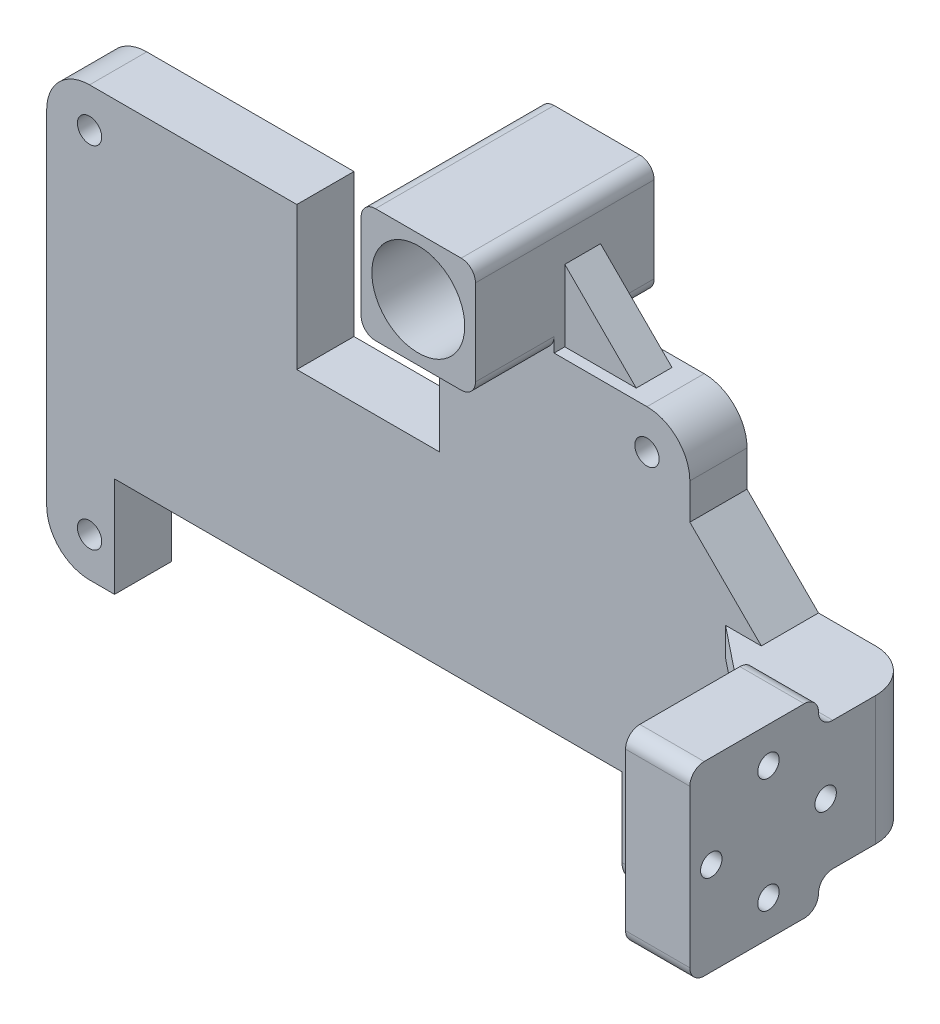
ISO-10303-21;
HEADER;
FILE_DESCRIPTION(('STEP AP214'),'2;1');
FILE_NAME('part.step','',(''),(''),'','','');
FILE_SCHEMA(('AUTOMOTIVE_DESIGN { 1 0 10303 214 1 1 1 1 }'));
ENDSEC;
DATA;
#1=APPLICATION_CONTEXT('core data for automotive mechanical design processes');
#2=APPLICATION_PROTOCOL_DEFINITION('international standard','automotive_design',2000,#1);
#3=PRODUCT_CONTEXT('',#1,'mechanical');
#4=PRODUCT('Part','Part','',(#3));
#5=PRODUCT_RELATED_PRODUCT_CATEGORY('part','',(#4));
#6=PRODUCT_DEFINITION_FORMATION('','',#4);
#7=PRODUCT_DEFINITION_CONTEXT('part definition',#1,'design');
#8=PRODUCT_DEFINITION('design','',#6,#7);
#9=PRODUCT_DEFINITION_SHAPE('','',#8);
#10=(LENGTH_UNIT() NAMED_UNIT(*) SI_UNIT(.MILLI.,.METRE.));
#11=(NAMED_UNIT(*) PLANE_ANGLE_UNIT() SI_UNIT($,.RADIAN.));
#12=(NAMED_UNIT(*) SI_UNIT($,.STERADIAN.) SOLID_ANGLE_UNIT());
#13=UNCERTAINTY_MEASURE_WITH_UNIT(LENGTH_MEASURE(1.E-05),#10,'distance_accuracy_value','');
#14=(GEOMETRIC_REPRESENTATION_CONTEXT(3) GLOBAL_UNCERTAINTY_ASSIGNED_CONTEXT((#13)) GLOBAL_UNIT_ASSIGNED_CONTEXT((#10,
#11,#12)) REPRESENTATION_CONTEXT('',''));
#15=CARTESIAN_POINT('',(0.,0.,0.));
#16=DIRECTION('',(0.,0.,1.));
#17=DIRECTION('',(1.,0.,0.));
#18=AXIS2_PLACEMENT_3D('',#15,#16,#17);
#19=CARTESIAN_POINT('',(0.,30.,0.));
#20=DIRECTION('',(0.,-1.,0.));
#21=DIRECTION('',(0.,0.,-1.));
#22=AXIS2_PLACEMENT_3D('',#19,#20,#21);
#23=PLANE('',#22);
#24=DIRECTION('',(1.,0.,0.));
#25=VECTOR('',#24,1.);
#26=CARTESIAN_POINT('',(0.,30.,0.));
#27=LINE('',#26,#25);
#28=CARTESIAN_POINT('',(12.,30.,0.));
#29=VERTEX_POINT('',#28);
#30=CARTESIAN_POINT('',(13.,30.,0.));
#31=VERTEX_POINT('',#30);
#32=EDGE_CURVE('E417',#29,#31,#27,.T.);
#33=ORIENTED_EDGE('',*,*,#32,.F.);
#34=DIRECTION('',(0.,0.,1.));
#35=VECTOR('',#34,1.);
#36=CARTESIAN_POINT('',(12.,30.,-6.));
#37=LINE('',#36,#35);
#38=CARTESIAN_POINT('',(12.,30.,-6.));
#39=VERTEX_POINT('',#38);
#40=EDGE_CURVE('E825',#29,#39,#37,.F.);
#41=ORIENTED_EDGE('',*,*,#40,.T.);
#42=DIRECTION('',(-1.,0.,0.));
#43=VECTOR('',#42,1.);
#44=CARTESIAN_POINT('',(9.99999999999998,30.,-6.));
#45=LINE('',#44,#43);
#46=CARTESIAN_POINT('',(13.,30.,-6.));
#47=VERTEX_POINT('',#46);
#48=EDGE_CURVE('E464',#47,#39,#45,.T.);
#49=ORIENTED_EDGE('',*,*,#48,.F.);
#50=DIRECTION('',(0.,0.,1.));
#51=VECTOR('',#50,1.);
#52=CARTESIAN_POINT('',(13.,30.,0.));
#53=LINE('',#52,#51);
#54=EDGE_CURVE('E411',#47,#31,#53,.T.);
#55=ORIENTED_EDGE('',*,*,#54,.T.);
#56=EDGE_LOOP('',(#33,#41,#49,#55));
#57=FACE_BOUND('',#56,.T.);
#58=ADVANCED_FACE('F39',(#57),#23,.T.);
#59=CARTESIAN_POINT('',(-45.,30.,8.));
#60=DIRECTION('',(0.,-1.,0.));
#61=DIRECTION('',(0.,0.,-1.));
#62=AXIS2_PLACEMENT_3D('',#59,#60,#61);
#63=PLANE('',#62);
#64=DIRECTION('',(0.,0.,-1.));
#65=VECTOR('',#64,1.);
#66=CARTESIAN_POINT('',(36.,30.,8.));
#67=LINE('',#66,#65);
#68=CARTESIAN_POINT('',(36.,30.,1.5));
#69=VERTEX_POINT('',#68);
#70=CARTESIAN_POINT('',(36.,30.,6.5));
#71=VERTEX_POINT('',#70);
#72=EDGE_CURVE('E441',#69,#71,#67,.F.);
#73=ORIENTED_EDGE('',*,*,#72,.T.);
#74=DIRECTION('',(-1.,0.,0.));
#75=VECTOR('',#74,1.);
#76=CARTESIAN_POINT('',(-45.,30.,6.5));
#77=LINE('',#76,#75);
#78=CARTESIAN_POINT('',(26.,30.,6.5));
#79=VERTEX_POINT('',#78);
#80=EDGE_CURVE('E437',#71,#79,#77,.T.);
#81=ORIENTED_EDGE('',*,*,#80,.T.);
#82=DIRECTION('',(0.,0.,-1.));
#83=VECTOR('',#82,1.);
#84=CARTESIAN_POINT('',(26.,30.,19.));
#85=LINE('',#84,#83);
#86=CARTESIAN_POINT('',(26.,30.,8.));
#87=VERTEX_POINT('',#86);
#88=EDGE_CURVE('E460',#87,#79,#85,.T.);
#89=ORIENTED_EDGE('',*,*,#88,.F.);
#90=DIRECTION('',(-1.,0.,0.));
#91=VECTOR('',#90,1.);
#92=CARTESIAN_POINT('',(-45.,30.,8.));
#93=LINE('',#92,#91);
#94=CARTESIAN_POINT('',(39.,30.,8.));
#95=VERTEX_POINT('',#94);
#96=EDGE_CURVE('E680',#95,#87,#93,.T.);
#97=ORIENTED_EDGE('',*,*,#96,.F.);
#98=DIRECTION('',(0.,0.,-1.));
#99=VECTOR('',#98,1.);
#100=CARTESIAN_POINT('',(39.,30.,8.));
#101=LINE('',#100,#99);
#102=CARTESIAN_POINT('',(39.,30.,0.));
#103=VERTEX_POINT('',#102);
#104=EDGE_CURVE('E716',#95,#103,#101,.T.);
#105=ORIENTED_EDGE('',*,*,#104,.T.);
#106=DIRECTION('',(-1.,0.,0.));
#107=VECTOR('',#106,1.);
#108=CARTESIAN_POINT('',(-45.,30.,0.));
#109=LINE('',#108,#107);
#110=CARTESIAN_POINT('',(26.,30.,0.));
#111=VERTEX_POINT('',#110);
#112=EDGE_CURVE('E693',#103,#111,#109,.T.);
#113=ORIENTED_EDGE('',*,*,#112,.T.);
#114=CARTESIAN_POINT('',(26.,30.,1.5));
#115=VERTEX_POINT('',#114);
#116=EDGE_CURVE('E447',#115,#111,#85,.T.);
#117=ORIENTED_EDGE('',*,*,#116,.F.);
#118=DIRECTION('',(-1.,0.,0.));
#119=VECTOR('',#118,1.);
#120=CARTESIAN_POINT('',(-45.,30.,1.5));
#121=LINE('',#120,#119);
#122=EDGE_CURVE('E432',#69,#115,#121,.T.);
#123=ORIENTED_EDGE('',*,*,#122,.F.);
#124=EDGE_LOOP('',(#73,#81,#89,#97,#105,#113,#117,#123));
#125=FACE_BOUND('',#124,.T.);
#126=ADVANCED_FACE('F934',(#125),#63,.F.);
#127=CARTESIAN_POINT('',(0.,0.,8.));
#128=DIRECTION('',(0.,0.,1.));
#129=DIRECTION('',(1.,0.,0.));
#130=AXIS2_PLACEMENT_3D('',#127,#128,#129);
#131=PLANE('',#130);
#132=DIRECTION('',(0.,-1.,0.));
#133=VECTOR('',#132,1.);
#134=CARTESIAN_POINT('',(35.5,-30.,8.));
#135=LINE('',#134,#133);
#136=CARTESIAN_POINT('',(35.5,-16.,8.));
#137=VERTEX_POINT('',#136);
#138=CARTESIAN_POINT('',(35.5,-27.,8.));
#139=VERTEX_POINT('',#138);
#140=EDGE_CURVE('E610',#137,#139,#135,.T.);
#141=ORIENTED_EDGE('',*,*,#140,.T.);
#142=DIRECTION('',(1.,0.,0.));
#143=VECTOR('',#142,1.);
#144=CARTESIAN_POINT('',(45.,-27.,8.));
#145=LINE('',#144,#143);
#146=CARTESIAN_POINT('',(45.,-27.,8.));
#147=VERTEX_POINT('',#146);
#148=EDGE_CURVE('E851',#139,#147,#145,.T.);
#149=ORIENTED_EDGE('',*,*,#148,.T.);
#150=DIRECTION('',(0.,1.,0.));
#151=VECTOR('',#150,1.);
#152=CARTESIAN_POINT('',(45.,30.,8.));
#153=LINE('',#152,#151);
#154=CARTESIAN_POINT('',(45.,-19.,8.));
#155=VERTEX_POINT('',#154);
#156=EDGE_CURVE('E676',#147,#155,#153,.T.);
#157=ORIENTED_EDGE('',*,*,#156,.T.);
#158=DIRECTION('',(-0.707106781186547,-0.707106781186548,0.));
#159=VECTOR('',#158,1.);
#160=CARTESIAN_POINT('',(32.,-32.,8.));
#161=LINE('',#160,#159);
#162=CARTESIAN_POINT('',(55.,-9.,8.));
#163=VERTEX_POINT('',#162);
#164=EDGE_CURVE('E571',#163,#155,#161,.T.);
#165=ORIENTED_EDGE('',*,*,#164,.F.);
#166=DIRECTION('',(-1.,0.,0.));
#167=VECTOR('',#166,1.);
#168=CARTESIAN_POINT('',(60.,-9.,8.));
#169=LINE('',#168,#167);
#170=CARTESIAN_POINT('',(50.,-9.,8.));
#171=VERTEX_POINT('',#170);
#172=EDGE_CURVE('E490',#163,#171,#169,.T.);
#173=ORIENTED_EDGE('',*,*,#172,.T.);
#174=DIRECTION('',(0.,1.,0.));
#175=VECTOR('',#174,1.);
#176=CARTESIAN_POINT('',(50.,-9.,8.));
#177=LINE('',#176,#175);
#178=CARTESIAN_POINT('',(50.,-5.,8.));
#179=VERTEX_POINT('',#178);
#180=EDGE_CURVE('E493',#171,#179,#177,.T.);
#181=ORIENTED_EDGE('',*,*,#180,.T.);
#182=DIRECTION('',(-1.,0.,0.));
#183=VECTOR('',#182,1.);
#184=CARTESIAN_POINT('',(60.,-5.,8.));
#185=LINE('',#184,#183);
#186=CARTESIAN_POINT('',(60.,-5.,8.));
#187=VERTEX_POINT('',#186);
#188=EDGE_CURVE('E487',#187,#179,#185,.T.);
#189=ORIENTED_EDGE('',*,*,#188,.F.);
#190=DIRECTION('',(0.,-1.,0.));
#191=VECTOR('',#190,1.);
#192=CARTESIAN_POINT('',(60.,9.,8.));
#193=LINE('',#192,#191);
#194=CARTESIAN_POINT('',(60.,5.,8.));
#195=VERTEX_POINT('',#194);
#196=EDGE_CURVE('E557',#195,#187,#193,.T.);
#197=ORIENTED_EDGE('',*,*,#196,.F.);
#198=DIRECTION('',(-1.,0.,0.));
#199=VECTOR('',#198,1.);
#200=CARTESIAN_POINT('',(60.,5.,8.));
#201=LINE('',#200,#199);
#202=CARTESIAN_POINT('',(50.,5.,8.));
#203=VERTEX_POINT('',#202);
#204=EDGE_CURVE('E517',#195,#203,#201,.T.);
#205=ORIENTED_EDGE('',*,*,#204,.T.);
#206=DIRECTION('',(0.,-1.,0.));
#207=VECTOR('',#206,1.);
#208=CARTESIAN_POINT('',(50.,9.,8.));
#209=LINE('',#208,#207);
#210=CARTESIAN_POINT('',(50.,9.,8.));
#211=VERTEX_POINT('',#210);
#212=EDGE_CURVE('E523',#211,#203,#209,.T.);
#213=ORIENTED_EDGE('',*,*,#212,.F.);
#214=DIRECTION('',(-1.,0.,0.));
#215=VECTOR('',#214,1.);
#216=CARTESIAN_POINT('',(60.,9.,8.));
#217=LINE('',#216,#215);
#218=CARTESIAN_POINT('',(55.,9.,8.));
#219=VERTEX_POINT('',#218);
#220=EDGE_CURVE('E509',#219,#211,#217,.T.);
#221=ORIENTED_EDGE('',*,*,#220,.F.);
#222=DIRECTION('',(-0.707106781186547,0.707106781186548,0.));
#223=VECTOR('',#222,1.);
#224=CARTESIAN_POINT('',(32.,32.,8.));
#225=LINE('',#224,#223);
#226=CARTESIAN_POINT('',(45.,19.,8.));
#227=VERTEX_POINT('',#226);
#228=EDGE_CURVE('E574',#219,#227,#225,.T.);
#229=ORIENTED_EDGE('',*,*,#228,.T.);
#230=CARTESIAN_POINT('',(45.,24.,8.));
#231=VERTEX_POINT('',#230);
#232=EDGE_CURVE('E679',#227,#231,#153,.T.);
#233=ORIENTED_EDGE('',*,*,#232,.T.);
#234=CARTESIAN_POINT('',(39.,24.,8.));
#235=DIRECTION('',(0.,0.,1.));
#236=DIRECTION('',(1.,0.,0.));
#237=AXIS2_PLACEMENT_3D('',#234,#235,#236);
#238=CIRCLE('',#237,6.);
#239=EDGE_CURVE('E721',#231,#95,#238,.T.);
#240=ORIENTED_EDGE('',*,*,#239,.T.);
#241=ORIENTED_EDGE('',*,*,#96,.T.);
#242=DIRECTION('',(0.,-1.,0.));
#243=VECTOR('',#242,1.);
#244=CARTESIAN_POINT('',(26.,0.,8.));
#245=LINE('',#244,#243);
#246=CARTESIAN_POINT('',(26.,32.,8.));
#247=VERTEX_POINT('',#246);
#248=EDGE_CURVE('E829',#247,#87,#245,.T.);
#249=ORIENTED_EDGE('',*,*,#248,.F.);
#250=CARTESIAN_POINT('',(24.,32.,8.));
#251=DIRECTION('',(0.,0.,1.));
#252=DIRECTION('',(1.,0.,0.));
#253=AXIS2_PLACEMENT_3D('',#250,#251,#252);
#254=CIRCLE('',#253,2.);
#255=CARTESIAN_POINT('',(24.,30.,8.));
#256=VERTEX_POINT('',#255);
#257=EDGE_CURVE('E849',#247,#256,#254,.F.);
#258=ORIENTED_EDGE('',*,*,#257,.T.);
#259=DIRECTION('',(1.,0.,0.));
#260=VECTOR('',#259,1.);
#261=CARTESIAN_POINT('',(0.,30.,8.));
#262=LINE('',#261,#260);
#263=CARTESIAN_POINT('',(12.,30.,8.));
#264=VERTEX_POINT('',#263);
#265=EDGE_CURVE('E480',#264,#256,#262,.T.);
#266=ORIENTED_EDGE('',*,*,#265,.F.);
#267=CARTESIAN_POINT('',(12.,32.,8.));
#268=DIRECTION('',(0.,0.,1.));
#269=DIRECTION('',(1.,0.,0.));
#270=AXIS2_PLACEMENT_3D('',#267,#268,#269);
#271=CIRCLE('',#270,2.);
#272=CARTESIAN_POINT('',(10.,32.,8.));
#273=VERTEX_POINT('',#272);
#274=EDGE_CURVE('E842',#264,#273,#271,.F.);
#275=ORIENTED_EDGE('',*,*,#274,.T.);
#276=DIRECTION('',(0.,-1.,0.));
#277=VECTOR('',#276,1.);
#278=CARTESIAN_POINT('',(10.,30.,8.));
#279=LINE('',#278,#277);
#280=CARTESIAN_POINT('',(10.,9.99999999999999,8.));
#281=VERTEX_POINT('',#280);
#282=EDGE_CURVE('E631',#273,#281,#279,.T.);
#283=ORIENTED_EDGE('',*,*,#282,.T.);
#284=DIRECTION('',(-1.,0.,0.));
#285=VECTOR('',#284,1.);
#286=CARTESIAN_POINT('',(10.,9.99999999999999,8.));
#287=LINE('',#286,#285);
#288=CARTESIAN_POINT('',(-10.,9.99999999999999,8.));
#289=VERTEX_POINT('',#288);
#290=EDGE_CURVE('E635',#281,#289,#287,.T.);
#291=ORIENTED_EDGE('',*,*,#290,.T.);
#292=DIRECTION('',(0.,1.,0.));
#293=VECTOR('',#292,1.);
#294=CARTESIAN_POINT('',(-10.,30.,8.));
#295=LINE('',#294,#293);
#296=CARTESIAN_POINT('',(-10.,30.,8.));
#297=VERTEX_POINT('',#296);
#298=EDGE_CURVE('E628',#289,#297,#295,.T.);
#299=ORIENTED_EDGE('',*,*,#298,.T.);
#300=CARTESIAN_POINT('',(-39.,30.,8.));
#301=VERTEX_POINT('',#300);
#302=EDGE_CURVE('E678',#297,#301,#93,.T.);
#303=ORIENTED_EDGE('',*,*,#302,.T.);
#304=CARTESIAN_POINT('',(-39.,24.,8.));
#305=DIRECTION('',(0.,0.,1.));
#306=DIRECTION('',(1.,0.,0.));
#307=AXIS2_PLACEMENT_3D('',#304,#305,#306);
#308=CIRCLE('',#307,6.);
#309=CARTESIAN_POINT('',(-45.,24.,8.));
#310=VERTEX_POINT('',#309);
#311=EDGE_CURVE('E725',#301,#310,#308,.T.);
#312=ORIENTED_EDGE('',*,*,#311,.T.);
#313=DIRECTION('',(0.,-1.,0.));
#314=VECTOR('',#313,1.);
#315=CARTESIAN_POINT('',(-45.,30.,8.));
#316=LINE('',#315,#314);
#317=CARTESIAN_POINT('',(-45.,-24.,8.));
#318=VERTEX_POINT('',#317);
#319=EDGE_CURVE('E683',#310,#318,#316,.T.);
#320=ORIENTED_EDGE('',*,*,#319,.T.);
#321=CARTESIAN_POINT('',(-39.,-24.,8.));
#322=DIRECTION('',(0.,0.,1.));
#323=DIRECTION('',(1.,0.,0.));
#324=AXIS2_PLACEMENT_3D('',#321,#322,#323);
#325=CIRCLE('',#324,6.);
#326=CARTESIAN_POINT('',(-39.,-30.,8.));
#327=VERTEX_POINT('',#326);
#328=EDGE_CURVE('E723',#318,#327,#325,.T.);
#329=ORIENTED_EDGE('',*,*,#328,.T.);
#330=DIRECTION('',(1.,0.,0.));
#331=VECTOR('',#330,1.);
#332=CARTESIAN_POINT('',(-45.,-30.,8.));
#333=LINE('',#332,#331);
#334=CARTESIAN_POINT('',(-35.5,-30.,8.));
#335=VERTEX_POINT('',#334);
#336=EDGE_CURVE('E686',#327,#335,#333,.T.);
#337=ORIENTED_EDGE('',*,*,#336,.T.);
#338=DIRECTION('',(0.,1.,0.));
#339=VECTOR('',#338,1.);
#340=CARTESIAN_POINT('',(-35.5,-30.,8.));
#341=LINE('',#340,#339);
#342=CARTESIAN_POINT('',(-35.5,-16.,8.));
#343=VERTEX_POINT('',#342);
#344=EDGE_CURVE('E603',#335,#343,#341,.T.);
#345=ORIENTED_EDGE('',*,*,#344,.T.);
#346=DIRECTION('',(1.,0.,0.));
#347=VECTOR('',#346,1.);
#348=CARTESIAN_POINT('',(35.5,-16.,8.));
#349=LINE('',#348,#347);
#350=EDGE_CURVE('E606',#343,#137,#349,.T.);
#351=ORIENTED_EDGE('',*,*,#350,.T.);
#352=EDGE_LOOP('',(#141,#149,#157,#165,#173,#181,#189,#197,#205,#213,#221,#229,#233,#240,#241,
#249,#258,#266,#275,#283,#291,#299,#303,#312,#320,#329,#337,#345,#351));
#353=FACE_BOUND('',#352,.T.);
#354=CARTESIAN_POINT('',(39.,24.5,8.));
#355=DIRECTION('',(0.,0.,1.));
#356=DIRECTION('',(1.,0.,0.));
#357=AXIS2_PLACEMENT_3D('',#354,#355,#356);
#358=CIRCLE('',#357,1.7);
#359=CARTESIAN_POINT('',(40.7,24.5,8.));
#360=VERTEX_POINT('',#359);
#361=EDGE_CURVE('E658',#360,#360,#358,.T.);
#362=ORIENTED_EDGE('',*,*,#361,.F.);
#363=EDGE_LOOP('',(#362));
#364=FACE_BOUND('',#363,.T.);
#365=CARTESIAN_POINT('',(-39.,-24.5,8.));
#366=DIRECTION('',(0.,0.,1.));
#367=DIRECTION('',(1.,0.,0.));
#368=AXIS2_PLACEMENT_3D('',#365,#366,#367);
#369=CIRCLE('',#368,1.7);
#370=CARTESIAN_POINT('',(-37.3,-24.5,8.));
#371=VERTEX_POINT('',#370);
#372=EDGE_CURVE('E670',#371,#371,#369,.T.);
#373=ORIENTED_EDGE('',*,*,#372,.F.);
#374=EDGE_LOOP('',(#373));
#375=FACE_BOUND('',#374,.T.);
#376=CARTESIAN_POINT('',(-39.,24.5,8.));
#377=DIRECTION('',(0.,0.,1.));
#378=DIRECTION('',(1.,0.,0.));
#379=AXIS2_PLACEMENT_3D('',#376,#377,#378);
#380=CIRCLE('',#379,1.7);
#381=CARTESIAN_POINT('',(-37.3,24.5,8.));
#382=VERTEX_POINT('',#381);
#383=EDGE_CURVE('E664',#382,#382,#380,.T.);
#384=ORIENTED_EDGE('',*,*,#383,.F.);
#385=EDGE_LOOP('',(#384));
#386=FACE_BOUND('',#385,.T.);
#387=CARTESIAN_POINT('',(39.,-24.5,8.));
#388=DIRECTION('',(0.,0.,1.));
#389=DIRECTION('',(1.,0.,0.));
#390=AXIS2_PLACEMENT_3D('',#387,#388,#389);
#391=CIRCLE('',#390,1.7);
#392=CARTESIAN_POINT('',(40.7,-24.5,8.));
#393=VERTEX_POINT('',#392);
#394=EDGE_CURVE('E652',#393,#393,#391,.T.);
#395=ORIENTED_EDGE('',*,*,#394,.F.);
#396=EDGE_LOOP('',(#395));
#397=FACE_BOUND('',#396,.T.);
#398=ADVANCED_FACE('F870',(#353,#364,#375,#386,#397),#131,.T.);
#399=CARTESIAN_POINT('',(60.,9.,32.));
#400=DIRECTION('',(1.,0.,0.));
#401=DIRECTION('',(0.,0.,-1.));
#402=AXIS2_PLACEMENT_3D('',#399,#400,#401);
#403=PLANE('',#402);
#404=CARTESIAN_POINT('',(60.,0.,13.));
#405=DIRECTION('',(1.,0.,0.));
#406=DIRECTION('',(0.,0.,-1.));
#407=AXIS2_PLACEMENT_3D('',#404,#405,#406);
#408=CIRCLE('',#407,1.5);
#409=CARTESIAN_POINT('',(60.,0.,11.5));
#410=VERTEX_POINT('',#409);
#411=EDGE_CURVE('E526',#410,#410,#408,.T.);
#412=ORIENTED_EDGE('',*,*,#411,.T.);
#413=EDGE_LOOP('',(#412));
#414=FACE_BOUND('',#413,.T.);
#415=CARTESIAN_POINT('',(60.,-8.,21.));
#416=DIRECTION('',(1.,0.,0.));
#417=DIRECTION('',(0.,0.,-1.));
#418=AXIS2_PLACEMENT_3D('',#415,#416,#417);
#419=CIRCLE('',#418,1.5);
#420=CARTESIAN_POINT('',(60.,-8.,19.5));
#421=VERTEX_POINT('',#420);
#422=EDGE_CURVE('E536',#421,#421,#419,.T.);
#423=ORIENTED_EDGE('',*,*,#422,.T.);
#424=EDGE_LOOP('',(#423));
#425=FACE_BOUND('',#424,.T.);
#426=CARTESIAN_POINT('',(60.,0.,29.));
#427=DIRECTION('',(1.,0.,0.));
#428=DIRECTION('',(0.,0.,-1.));
#429=AXIS2_PLACEMENT_3D('',#426,#427,#428);
#430=CIRCLE('',#429,1.5);
#431=CARTESIAN_POINT('',(60.,0.,27.5));
#432=VERTEX_POINT('',#431);
#433=EDGE_CURVE('E542',#432,#432,#430,.T.);
#434=ORIENTED_EDGE('',*,*,#433,.T.);
#435=EDGE_LOOP('',(#434));
#436=FACE_BOUND('',#435,.T.);
#437=CARTESIAN_POINT('',(60.,8.,20.9999999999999));
#438=DIRECTION('',(1.,0.,0.));
#439=DIRECTION('',(0.,0.,-1.));
#440=AXIS2_PLACEMENT_3D('',#437,#438,#439);
#441=CIRCLE('',#440,1.5);
#442=CARTESIAN_POINT('',(60.,8.,19.4999999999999));
#443=VERTEX_POINT('',#442);
#444=EDGE_CURVE('E525',#443,#443,#441,.T.);
#445=ORIENTED_EDGE('',*,*,#444,.T.);
#446=EDGE_LOOP('',(#445));
#447=FACE_BOUND('',#446,.T.);
#448=DIRECTION('',(0.,0.,-1.));
#449=VECTOR('',#448,1.);
#450=CARTESIAN_POINT('',(60.,-9.,8.));
#451=LINE('',#450,#449);
#452=CARTESIAN_POINT('',(60.,-9.,16.));
#453=VERTEX_POINT('',#452);
#454=CARTESIAN_POINT('',(60.,-9.,12.));
#455=VERTEX_POINT('',#454);
#456=EDGE_CURVE('E484',#453,#455,#451,.T.);
#457=ORIENTED_EDGE('',*,*,#456,.T.);
#458=CARTESIAN_POINT('',(60.,-11.,12.));
#459=DIRECTION('',(1.,0.,0.));
#460=DIRECTION('',(0.,0.,-1.));
#461=AXIS2_PLACEMENT_3D('',#458,#459,#460);
#462=CIRCLE('',#461,2.);
#463=CARTESIAN_POINT('',(60.,-11.,14.));
#464=VERTEX_POINT('',#463);
#465=EDGE_CURVE('E780',#455,#464,#462,.T.);
#466=ORIENTED_EDGE('',*,*,#465,.T.);
#467=CARTESIAN_POINT('',(60.,-11.,16.));
#468=DIRECTION('',(1.,0.,0.));
#469=DIRECTION('',(0.,0.,-1.));
#470=AXIS2_PLACEMENT_3D('',#467,#468,#469);
#471=CIRCLE('',#470,2.);
#472=CARTESIAN_POINT('',(60.,-13.,16.));
#473=VERTEX_POINT('',#472);
#474=EDGE_CURVE('E760',#464,#473,#471,.F.);
#475=ORIENTED_EDGE('',*,*,#474,.T.);
#476=DIRECTION('',(0.,0.,-1.));
#477=VECTOR('',#476,1.);
#478=CARTESIAN_POINT('',(60.,-13.,14.));
#479=LINE('',#478,#477);
#480=CARTESIAN_POINT('',(60.,-13.,30.));
#481=VERTEX_POINT('',#480);
#482=EDGE_CURVE('E550',#481,#473,#479,.T.);
#483=ORIENTED_EDGE('',*,*,#482,.F.);
#484=CARTESIAN_POINT('',(60.,-11.,30.));
#485=DIRECTION('',(1.,0.,0.));
#486=DIRECTION('',(0.,0.,-1.));
#487=AXIS2_PLACEMENT_3D('',#484,#485,#486);
#488=CIRCLE('',#487,2.);
#489=CARTESIAN_POINT('',(60.,-11.,32.));
#490=VERTEX_POINT('',#489);
#491=EDGE_CURVE('E758',#481,#490,#488,.F.);
#492=ORIENTED_EDGE('',*,*,#491,.T.);
#493=DIRECTION('',(0.,-1.,0.));
#494=VECTOR('',#493,1.);
#495=CARTESIAN_POINT('',(60.,9.,32.));
#496=LINE('',#495,#494);
#497=CARTESIAN_POINT('',(60.,11.,32.));
#498=VERTEX_POINT('',#497);
#499=EDGE_CURVE('E562',#498,#490,#496,.T.);
#500=ORIENTED_EDGE('',*,*,#499,.F.);
#501=CARTESIAN_POINT('',(60.,11.,30.));
#502=DIRECTION('',(1.,0.,0.));
#503=DIRECTION('',(0.,0.,-1.));
#504=AXIS2_PLACEMENT_3D('',#501,#502,#503);
#505=CIRCLE('',#504,2.);
#506=CARTESIAN_POINT('',(60.,13.,30.));
#507=VERTEX_POINT('',#506);
#508=EDGE_CURVE('E756',#498,#507,#505,.F.);
#509=ORIENTED_EDGE('',*,*,#508,.T.);
#510=DIRECTION('',(0.,0.,1.));
#511=VECTOR('',#510,1.);
#512=CARTESIAN_POINT('',(60.,13.,14.));
#513=LINE('',#512,#511);
#514=CARTESIAN_POINT('',(60.,13.,16.));
#515=VERTEX_POINT('',#514);
#516=EDGE_CURVE('E553',#515,#507,#513,.T.);
#517=ORIENTED_EDGE('',*,*,#516,.F.);
#518=CARTESIAN_POINT('',(60.,11.,16.));
#519=DIRECTION('',(1.,0.,0.));
#520=DIRECTION('',(0.,0.,-1.));
#521=AXIS2_PLACEMENT_3D('',#518,#519,#520);
#522=CIRCLE('',#521,2.);
#523=CARTESIAN_POINT('',(60.,11.,14.));
#524=VERTEX_POINT('',#523);
#525=EDGE_CURVE('E754',#515,#524,#522,.F.);
#526=ORIENTED_EDGE('',*,*,#525,.T.);
#527=CARTESIAN_POINT('',(60.,11.,12.));
#528=DIRECTION('',(1.,0.,0.));
#529=DIRECTION('',(0.,0.,-1.));
#530=AXIS2_PLACEMENT_3D('',#527,#528,#529);
#531=CIRCLE('',#530,2.);
#532=CARTESIAN_POINT('',(60.,9.,12.));
#533=VERTEX_POINT('',#532);
#534=EDGE_CURVE('E784',#524,#533,#531,.T.);
#535=ORIENTED_EDGE('',*,*,#534,.T.);
#536=DIRECTION('',(0.,0.,-1.));
#537=VECTOR('',#536,1.);
#538=CARTESIAN_POINT('',(60.,9.,8.));
#539=LINE('',#538,#537);
#540=CARTESIAN_POINT('',(60.,9.,16.));
#541=VERTEX_POINT('',#540);
#542=EDGE_CURVE('E507',#541,#533,#539,.T.);
#543=ORIENTED_EDGE('',*,*,#542,.F.);
#544=DIRECTION('',(0.,-1.,0.));
#545=VECTOR('',#544,1.);
#546=CARTESIAN_POINT('',(60.,9.,16.));
#547=LINE('',#546,#545);
#548=CARTESIAN_POINT('',(60.,5.,16.));
#549=VERTEX_POINT('',#548);
#550=EDGE_CURVE('E514',#541,#549,#547,.T.);
#551=ORIENTED_EDGE('',*,*,#550,.T.);
#552=DIRECTION('',(0.,0.,-1.));
#553=VECTOR('',#552,1.);
#554=CARTESIAN_POINT('',(60.,5.,8.));
#555=LINE('',#554,#553);
#556=EDGE_CURVE('E506',#549,#195,#555,.T.);
#557=ORIENTED_EDGE('',*,*,#556,.T.);
#558=ORIENTED_EDGE('',*,*,#196,.T.);
#559=DIRECTION('',(0.,0.,-1.));
#560=VECTOR('',#559,1.);
#561=CARTESIAN_POINT('',(60.,-5.,8.));
#562=LINE('',#561,#560);
#563=CARTESIAN_POINT('',(60.,-5.,16.));
#564=VERTEX_POINT('',#563);
#565=EDGE_CURVE('E494',#564,#187,#562,.T.);
#566=ORIENTED_EDGE('',*,*,#565,.F.);
#567=DIRECTION('',(0.,1.,0.));
#568=VECTOR('',#567,1.);
#569=CARTESIAN_POINT('',(60.,-9.,16.));
#570=LINE('',#569,#568);
#571=EDGE_CURVE('E504',#453,#564,#570,.T.);
#572=ORIENTED_EDGE('',*,*,#571,.F.);
#573=EDGE_LOOP('',(#457,#466,#475,#483,#492,#500,#509,#517,#526,#535,#543,#551,#557,#558,#566,#572));
#574=FACE_BOUND('',#573,.T.);
#575=ADVANCED_FACE('F898',(#414,#425,#436,#447,#574),#403,.F.);
#576=CARTESIAN_POINT('',(45.,30.,8.));
#577=DIRECTION('',(-1.,0.,0.));
#578=DIRECTION('',(0.,-1.,0.));
#579=AXIS2_PLACEMENT_3D('',#576,#577,#578);
#580=PLANE('',#579);
#581=DIRECTION('',(0.,0.,-1.));
#582=VECTOR('',#581,1.);
#583=CARTESIAN_POINT('',(45.,19.,8.));
#584=LINE('',#583,#582);
#585=CARTESIAN_POINT('',(45.,19.,0.));
#586=VERTEX_POINT('',#585);
#587=EDGE_CURVE('E595',#227,#586,#584,.T.);
#588=ORIENTED_EDGE('',*,*,#587,.T.);
#589=DIRECTION('',(0.,1.,0.));
#590=VECTOR('',#589,1.);
#591=CARTESIAN_POINT('',(45.,30.,0.));
#592=LINE('',#591,#590);
#593=CARTESIAN_POINT('',(45.,24.,0.));
#594=VERTEX_POINT('',#593);
#595=EDGE_CURVE('E673',#586,#594,#592,.T.);
#596=ORIENTED_EDGE('',*,*,#595,.T.);
#597=DIRECTION('',(0.,0.,-1.));
#598=VECTOR('',#597,1.);
#599=CARTESIAN_POINT('',(45.,24.,8.));
#600=LINE('',#599,#598);
#601=EDGE_CURVE('E729',#594,#231,#600,.F.);
#602=ORIENTED_EDGE('',*,*,#601,.T.);
#603=ORIENTED_EDGE('',*,*,#232,.F.);
#604=EDGE_LOOP('',(#588,#596,#602,#603));
#605=FACE_BOUND('',#604,.T.);
#606=ADVANCED_FACE('F922',(#605),#580,.F.);
#607=CARTESIAN_POINT('',(-45.,-30.,8.));
#608=DIRECTION('',(0.,1.,0.));
#609=DIRECTION('',(0.,0.,1.));
#610=AXIS2_PLACEMENT_3D('',#607,#608,#609);
#611=PLANE('',#610);
#612=DIRECTION('',(0.,0.,-1.));
#613=VECTOR('',#612,1.);
#614=CARTESIAN_POINT('',(45.,-30.,8.));
#615=LINE('',#614,#613);
#616=CARTESIAN_POINT('',(45.,-30.,5.));
#617=VERTEX_POINT('',#616);
#618=CARTESIAN_POINT('',(45.,-30.,3.));
#619=VERTEX_POINT('',#618);
#620=EDGE_CURVE('E689',#617,#619,#615,.T.);
#621=ORIENTED_EDGE('',*,*,#620,.F.);
#622=DIRECTION('',(1.,0.,0.));
#623=VECTOR('',#622,1.);
#624=CARTESIAN_POINT('',(35.5,-30.,5.));
#625=LINE('',#624,#623);
#626=CARTESIAN_POINT('',(35.5,-30.,5.));
#627=VERTEX_POINT('',#626);
#628=EDGE_CURVE('E861',#617,#627,#625,.F.);
#629=ORIENTED_EDGE('',*,*,#628,.T.);
#630=DIRECTION('',(0.,0.,-1.));
#631=VECTOR('',#630,1.);
#632=CARTESIAN_POINT('',(35.5,-30.,8.));
#633=LINE('',#632,#631);
#634=CARTESIAN_POINT('',(35.5,-30.,3.));
#635=VERTEX_POINT('',#634);
#636=EDGE_CURVE('E620',#627,#635,#633,.T.);
#637=ORIENTED_EDGE('',*,*,#636,.T.);
#638=DIRECTION('',(1.,0.,0.));
#639=VECTOR('',#638,1.);
#640=CARTESIAN_POINT('',(-45.,-30.,3.));
#641=LINE('',#640,#639);
#642=EDGE_CURVE('E858',#635,#619,#641,.T.);
#643=ORIENTED_EDGE('',*,*,#642,.T.);
#644=EDGE_LOOP('',(#621,#629,#637,#643));
#645=FACE_BOUND('',#644,.T.);
#646=ADVANCED_FACE('F880',(#645),#611,.F.);
#647=DIRECTION('',(0.,0.,-1.));
#648=VECTOR('',#647,1.);
#649=CARTESIAN_POINT('',(-10.,30.,8.));
#650=LINE('',#649,#648);
#651=CARTESIAN_POINT('',(-10.,30.,0.));
#652=VERTEX_POINT('',#651);
#653=EDGE_CURVE('E638',#297,#652,#650,.T.);
#654=ORIENTED_EDGE('',*,*,#653,.T.);
#655=CARTESIAN_POINT('',(-39.,30.,0.));
#656=VERTEX_POINT('',#655);
#657=EDGE_CURVE('E692',#652,#656,#109,.T.);
#658=ORIENTED_EDGE('',*,*,#657,.T.);
#659=DIRECTION('',(0.,0.,-1.));
#660=VECTOR('',#659,1.);
#661=CARTESIAN_POINT('',(-39.,30.,8.));
#662=LINE('',#661,#660);
#663=EDGE_CURVE('E719',#656,#301,#662,.F.);
#664=ORIENTED_EDGE('',*,*,#663,.T.);
#665=ORIENTED_EDGE('',*,*,#302,.F.);
#666=EDGE_LOOP('',(#654,#658,#664,#665));
#667=FACE_BOUND('',#666,.T.);
#668=ADVANCED_FACE('F1003',(#667),#63,.F.);
#669=CARTESIAN_POINT('',(0.,0.,0.));
#670=DIRECTION('',(0.,0.,1.));
#671=DIRECTION('',(1.,0.,0.));
#672=AXIS2_PLACEMENT_3D('',#669,#670,#671);
#673=PLANE('',#672);
#674=CARTESIAN_POINT('',(45.,-27.,0.));
#675=VERTEX_POINT('',#674);
#676=CARTESIAN_POINT('',(45.,-19.,0.));
#677=VERTEX_POINT('',#676);
#678=EDGE_CURVE('E690',#675,#677,#592,.T.);
#679=ORIENTED_EDGE('',*,*,#678,.F.);
#680=DIRECTION('',(1.,0.,0.));
#681=VECTOR('',#680,1.);
#682=CARTESIAN_POINT('',(0.,-27.,0.));
#683=LINE('',#682,#681);
#684=CARTESIAN_POINT('',(35.5,-27.,0.));
#685=VERTEX_POINT('',#684);
#686=EDGE_CURVE('E11',#675,#685,#683,.F.);
#687=ORIENTED_EDGE('',*,*,#686,.T.);
#688=DIRECTION('',(0.,-1.,0.));
#689=VECTOR('',#688,1.);
#690=CARTESIAN_POINT('',(35.5,-30.,0.));
#691=LINE('',#690,#689);
#692=CARTESIAN_POINT('',(35.5,-16.,0.));
#693=VERTEX_POINT('',#692);
#694=EDGE_CURVE('E607',#693,#685,#691,.T.);
#695=ORIENTED_EDGE('',*,*,#694,.F.);
#696=DIRECTION('',(1.,0.,0.));
#697=VECTOR('',#696,1.);
#698=CARTESIAN_POINT('',(35.5,-16.,0.));
#699=LINE('',#698,#697);
#700=CARTESIAN_POINT('',(-35.5,-16.,0.));
#701=VERTEX_POINT('',#700);
#702=EDGE_CURVE('E616',#701,#693,#699,.T.);
#703=ORIENTED_EDGE('',*,*,#702,.F.);
#704=DIRECTION('',(0.,1.,0.));
#705=VECTOR('',#704,1.);
#706=CARTESIAN_POINT('',(-35.5,-30.,0.));
#707=LINE('',#706,#705);
#708=CARTESIAN_POINT('',(-35.5,-30.,0.));
#709=VERTEX_POINT('',#708);
#710=EDGE_CURVE('E592',#709,#701,#707,.T.);
#711=ORIENTED_EDGE('',*,*,#710,.F.);
#712=DIRECTION('',(1.,0.,0.));
#713=VECTOR('',#712,1.);
#714=CARTESIAN_POINT('',(-45.,-30.,0.));
#715=LINE('',#714,#713);
#716=CARTESIAN_POINT('',(-39.,-30.,0.));
#717=VERTEX_POINT('',#716);
#718=EDGE_CURVE('E699',#717,#709,#715,.T.);
#719=ORIENTED_EDGE('',*,*,#718,.F.);
#720=CARTESIAN_POINT('',(-39.,-24.,0.));
#721=DIRECTION('',(0.,0.,1.));
#722=DIRECTION('',(1.,0.,0.));
#723=AXIS2_PLACEMENT_3D('',#720,#721,#722);
#724=CIRCLE('',#723,6.);
#725=CARTESIAN_POINT('',(-45.,-24.,0.));
#726=VERTEX_POINT('',#725);
#727=EDGE_CURVE('E711',#717,#726,#724,.F.);
#728=ORIENTED_EDGE('',*,*,#727,.T.);
#729=DIRECTION('',(0.,-1.,0.));
#730=VECTOR('',#729,1.);
#731=CARTESIAN_POINT('',(-45.,30.,0.));
#732=LINE('',#731,#730);
#733=CARTESIAN_POINT('',(-45.,24.,0.));
#734=VERTEX_POINT('',#733);
#735=EDGE_CURVE('E696',#734,#726,#732,.T.);
#736=ORIENTED_EDGE('',*,*,#735,.F.);
#737=CARTESIAN_POINT('',(-39.,24.,0.));
#738=DIRECTION('',(0.,0.,1.));
#739=DIRECTION('',(1.,0.,0.));
#740=AXIS2_PLACEMENT_3D('',#737,#738,#739);
#741=CIRCLE('',#740,6.);
#742=EDGE_CURVE('E713',#734,#656,#741,.F.);
#743=ORIENTED_EDGE('',*,*,#742,.T.);
#744=ORIENTED_EDGE('',*,*,#657,.F.);
#745=DIRECTION('',(0.,1.,0.));
#746=VECTOR('',#745,1.);
#747=CARTESIAN_POINT('',(-10.,30.,0.));
#748=LINE('',#747,#746);
#749=CARTESIAN_POINT('',(-10.,9.99999999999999,0.));
#750=VERTEX_POINT('',#749);
#751=EDGE_CURVE('E622',#750,#652,#748,.T.);
#752=ORIENTED_EDGE('',*,*,#751,.F.);
#753=DIRECTION('',(-1.,0.,0.));
#754=VECTOR('',#753,1.);
#755=CARTESIAN_POINT('',(10.,9.99999999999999,0.));
#756=LINE('',#755,#754);
#757=CARTESIAN_POINT('',(10.,9.99999999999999,0.));
#758=VERTEX_POINT('',#757);
#759=EDGE_CURVE('E632',#758,#750,#756,.T.);
#760=ORIENTED_EDGE('',*,*,#759,.F.);
#761=DIRECTION('',(0.,-1.,0.));
#762=VECTOR('',#761,1.);
#763=CARTESIAN_POINT('',(10.,30.,0.));
#764=LINE('',#763,#762);
#765=CARTESIAN_POINT('',(10.,32.,0.));
#766=VERTEX_POINT('',#765);
#767=EDGE_CURVE('E641',#766,#758,#764,.T.);
#768=ORIENTED_EDGE('',*,*,#767,.F.);
#769=CARTESIAN_POINT('',(12.,32.,0.));
#770=DIRECTION('',(0.,0.,1.));
#771=DIRECTION('',(1.,0.,0.));
#772=AXIS2_PLACEMENT_3D('',#769,#770,#771);
#773=CIRCLE('',#772,2.);
#774=EDGE_CURVE('E845',#766,#29,#773,.T.);
#775=ORIENTED_EDGE('',*,*,#774,.T.);
#776=ORIENTED_EDGE('',*,*,#32,.T.);
#777=DIRECTION('',(0.,1.,0.));
#778=VECTOR('',#777,1.);
#779=CARTESIAN_POINT('',(13.,0.,0.));
#780=LINE('',#779,#778);
#781=CARTESIAN_POINT('',(13.,24.,0.));
#782=VERTEX_POINT('',#781);
#783=EDGE_CURVE('E409',#782,#31,#780,.T.);
#784=ORIENTED_EDGE('',*,*,#783,.F.);
#785=DIRECTION('',(-1.,0.,0.));
#786=VECTOR('',#785,1.);
#787=CARTESIAN_POINT('',(0.,24.,0.));
#788=LINE('',#787,#786);
#789=CARTESIAN_POINT('',(23.,24.,0.));
#790=VERTEX_POINT('',#789);
#791=EDGE_CURVE('E393',#782,#790,#788,.F.);
#792=ORIENTED_EDGE('',*,*,#791,.T.);
#793=DIRECTION('',(0.,1.,0.));
#794=VECTOR('',#793,1.);
#795=CARTESIAN_POINT('',(23.,0.,0.));
#796=LINE('',#795,#794);
#797=CARTESIAN_POINT('',(23.,30.,-2.75907768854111E-12));
#798=VERTEX_POINT('',#797);
#799=EDGE_CURVE('E404',#790,#798,#796,.T.);
#800=ORIENTED_EDGE('',*,*,#799,.T.);
#801=CARTESIAN_POINT('',(24.,30.,0.));
#802=VERTEX_POINT('',#801);
#803=EDGE_CURVE('E478',#798,#802,#27,.T.);
#804=ORIENTED_EDGE('',*,*,#803,.T.);
#805=CARTESIAN_POINT('',(24.,32.,0.));
#806=DIRECTION('',(0.,0.,1.));
#807=DIRECTION('',(1.,0.,0.));
#808=AXIS2_PLACEMENT_3D('',#805,#806,#807);
#809=CIRCLE('',#808,2.);
#810=CARTESIAN_POINT('',(26.,32.,0.));
#811=VERTEX_POINT('',#810);
#812=EDGE_CURVE('E847',#802,#811,#809,.T.);
#813=ORIENTED_EDGE('',*,*,#812,.T.);
#814=DIRECTION('',(0.,1.,0.));
#815=VECTOR('',#814,1.);
#816=CARTESIAN_POINT('',(26.,46.,0.));
#817=LINE('',#816,#815);
#818=EDGE_CURVE('E834',#111,#811,#817,.T.);
#819=ORIENTED_EDGE('',*,*,#818,.F.);
#820=ORIENTED_EDGE('',*,*,#112,.F.);
#821=CARTESIAN_POINT('',(39.,24.,0.));
#822=DIRECTION('',(0.,0.,1.));
#823=DIRECTION('',(1.,0.,0.));
#824=AXIS2_PLACEMENT_3D('',#821,#822,#823);
#825=CIRCLE('',#824,6.);
#826=EDGE_CURVE('E708',#103,#594,#825,.F.);
#827=ORIENTED_EDGE('',*,*,#826,.T.);
#828=ORIENTED_EDGE('',*,*,#595,.F.);
#829=DIRECTION('',(-0.707106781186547,0.707106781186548,0.));
#830=VECTOR('',#829,1.);
#831=CARTESIAN_POINT('',(32.,32.,0.));
#832=LINE('',#831,#830);
#833=CARTESIAN_POINT('',(55.,9.,0.));
#834=VERTEX_POINT('',#833);
#835=EDGE_CURVE('E584',#834,#586,#832,.T.);
#836=ORIENTED_EDGE('',*,*,#835,.F.);
#837=DIRECTION('',(-1.,0.,0.));
#838=VECTOR('',#837,1.);
#839=CARTESIAN_POINT('',(0.,8.99999999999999,0.));
#840=LINE('',#839,#838);
#841=CARTESIAN_POINT('',(63.,9.,0.));
#842=VERTEX_POINT('',#841);
#843=EDGE_CURVE('E575',#842,#834,#840,.T.);
#844=ORIENTED_EDGE('',*,*,#843,.F.);
#845=DIRECTION('',(0.,1.,0.));
#846=VECTOR('',#845,1.);
#847=CARTESIAN_POINT('',(63.,0.,0.));
#848=LINE('',#847,#846);
#849=CARTESIAN_POINT('',(63.,-9.,0.));
#850=VERTEX_POINT('',#849);
#851=EDGE_CURVE('E736',#842,#850,#848,.F.);
#852=ORIENTED_EDGE('',*,*,#851,.T.);
#853=DIRECTION('',(-1.,0.,0.));
#854=VECTOR('',#853,1.);
#855=CARTESIAN_POINT('',(0.,-9.,0.));
#856=LINE('',#855,#854);
#857=CARTESIAN_POINT('',(55.,-9.,0.));
#858=VERTEX_POINT('',#857);
#859=EDGE_CURVE('E568',#850,#858,#856,.T.);
#860=ORIENTED_EDGE('',*,*,#859,.T.);
#861=DIRECTION('',(-0.707106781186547,-0.707106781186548,0.));
#862=VECTOR('',#861,1.);
#863=CARTESIAN_POINT('',(32.,-32.,0.));
#864=LINE('',#863,#862);
#865=EDGE_CURVE('E581',#858,#677,#864,.T.);
#866=ORIENTED_EDGE('',*,*,#865,.T.);
#867=EDGE_LOOP('',(#679,#687,#695,#703,#711,#719,#728,#736,#743,#744,#752,#760,#768,#775,#776,
#784,#792,#800,#804,#813,#819,#820,#827,#828,#836,#844,#852,#860,#866));
#868=FACE_BOUND('',#867,.T.);
#869=CARTESIAN_POINT('',(-39.,-24.5,0.));
#870=DIRECTION('',(0.,0.,1.));
#871=DIRECTION('',(1.,0.,0.));
#872=AXIS2_PLACEMENT_3D('',#869,#870,#871);
#873=CIRCLE('',#872,1.7);
#874=CARTESIAN_POINT('',(-37.3,-24.5,0.));
#875=VERTEX_POINT('',#874);
#876=EDGE_CURVE('E667',#875,#875,#873,.T.);
#877=ORIENTED_EDGE('',*,*,#876,.T.);
#878=EDGE_LOOP('',(#877));
#879=FACE_BOUND('',#878,.T.);
#880=CARTESIAN_POINT('',(-39.,24.5,0.));
#881=DIRECTION('',(0.,0.,1.));
#882=DIRECTION('',(1.,0.,0.));
#883=AXIS2_PLACEMENT_3D('',#880,#881,#882);
#884=CIRCLE('',#883,1.7);
#885=CARTESIAN_POINT('',(-37.3,24.5,0.));
#886=VERTEX_POINT('',#885);
#887=EDGE_CURVE('E661',#886,#886,#884,.T.);
#888=ORIENTED_EDGE('',*,*,#887,.T.);
#889=EDGE_LOOP('',(#888));
#890=FACE_BOUND('',#889,.T.);
#891=CARTESIAN_POINT('',(39.,24.5,0.));
#892=DIRECTION('',(0.,0.,1.));
#893=DIRECTION('',(1.,0.,0.));
#894=AXIS2_PLACEMENT_3D('',#891,#892,#893);
#895=CIRCLE('',#894,1.7);
#896=CARTESIAN_POINT('',(40.7,24.5,0.));
#897=VERTEX_POINT('',#896);
#898=EDGE_CURVE('E655',#897,#897,#895,.T.);
#899=ORIENTED_EDGE('',*,*,#898,.T.);
#900=EDGE_LOOP('',(#899));
#901=FACE_BOUND('',#900,.T.);
#902=CARTESIAN_POINT('',(39.,-24.5,0.));
#903=DIRECTION('',(0.,0.,1.));
#904=DIRECTION('',(1.,0.,0.));
#905=AXIS2_PLACEMENT_3D('',#902,#903,#904);
#906=CIRCLE('',#905,1.7);
#907=CARTESIAN_POINT('',(40.7,-24.5,0.));
#908=VERTEX_POINT('',#907);
#909=EDGE_CURVE('E648',#908,#908,#906,.T.);
#910=ORIENTED_EDGE('',*,*,#909,.T.);
#911=EDGE_LOOP('',(#910));
#912=FACE_BOUND('',#911,.T.);
#913=ADVANCED_FACE('F414',(#868,#879,#890,#901,#912),#673,.F.);
#914=ORIENTED_EDGE('',*,*,#156,.F.);
#915=CARTESIAN_POINT('',(45.,-27.,5.));
#916=DIRECTION('',(-1.,0.,0.));
#917=DIRECTION('',(0.,-1.,0.));
#918=AXIS2_PLACEMENT_3D('',#915,#916,#917);
#919=CIRCLE('',#918,3.);
#920=EDGE_CURVE('E856',#147,#617,#919,.F.);
#921=ORIENTED_EDGE('',*,*,#920,.T.);
#922=ORIENTED_EDGE('',*,*,#620,.T.);
#923=CARTESIAN_POINT('',(45.,-27.,3.));
#924=DIRECTION('',(-1.,0.,0.));
#925=DIRECTION('',(0.,-1.,0.));
#926=AXIS2_PLACEMENT_3D('',#923,#924,#925);
#927=CIRCLE('',#926,3.);
#928=EDGE_CURVE('E854',#619,#675,#927,.F.);
#929=ORIENTED_EDGE('',*,*,#928,.T.);
#930=ORIENTED_EDGE('',*,*,#678,.T.);
#931=DIRECTION('',(0.,0.,-1.));
#932=VECTOR('',#931,1.);
#933=CARTESIAN_POINT('',(45.,-19.,8.));
#934=LINE('',#933,#932);
#935=EDGE_CURVE('E597',#155,#677,#934,.T.);
#936=ORIENTED_EDGE('',*,*,#935,.F.);
#937=EDGE_LOOP('',(#914,#921,#922,#929,#930,#936));
#938=FACE_BOUND('',#937,.T.);
#939=ADVANCED_FACE('F877',(#938),#580,.F.);
#940=CARTESIAN_POINT('',(-45.,30.,8.));
#941=DIRECTION('',(1.,0.,0.));
#942=DIRECTION('',(0.,0.,-1.));
#943=AXIS2_PLACEMENT_3D('',#940,#941,#942);
#944=PLANE('',#943);
#945=DIRECTION('',(0.,0.,-1.));
#946=VECTOR('',#945,1.);
#947=CARTESIAN_POINT('',(-45.,24.,8.));
#948=LINE('',#947,#946);
#949=EDGE_CURVE('E706',#310,#734,#948,.T.);
#950=ORIENTED_EDGE('',*,*,#949,.T.);
#951=ORIENTED_EDGE('',*,*,#735,.T.);
#952=DIRECTION('',(0.,0.,-1.));
#953=VECTOR('',#952,1.);
#954=CARTESIAN_POINT('',(-45.,-24.,8.));
#955=LINE('',#954,#953);
#956=EDGE_CURVE('E704',#726,#318,#955,.F.);
#957=ORIENTED_EDGE('',*,*,#956,.T.);
#958=ORIENTED_EDGE('',*,*,#319,.F.);
#959=EDGE_LOOP('',(#950,#951,#957,#958));
#960=FACE_BOUND('',#959,.T.);
#961=ADVANCED_FACE('F1014',(#960),#944,.F.);
#962=DIRECTION('',(0.,0.,-1.));
#963=VECTOR('',#962,1.);
#964=CARTESIAN_POINT('',(-39.,-30.,8.));
#965=LINE('',#964,#963);
#966=EDGE_CURVE('E727',#327,#717,#965,.T.);
#967=ORIENTED_EDGE('',*,*,#966,.T.);
#968=ORIENTED_EDGE('',*,*,#718,.T.);
#969=DIRECTION('',(0.,0.,-1.));
#970=VECTOR('',#969,1.);
#971=CARTESIAN_POINT('',(-35.5,-30.,8.));
#972=LINE('',#971,#970);
#973=EDGE_CURVE('E613',#335,#709,#972,.T.);
#974=ORIENTED_EDGE('',*,*,#973,.F.);
#975=ORIENTED_EDGE('',*,*,#336,.F.);
#976=EDGE_LOOP('',(#967,#968,#974,#975));
#977=FACE_BOUND('',#976,.T.);
#978=ADVANCED_FACE('F1024',(#977),#611,.F.);
#979=CARTESIAN_POINT('',(-39.,-24.5,8.));
#980=DIRECTION('',(0.,0.,-1.));
#981=DIRECTION('',(-1.,0.,0.));
#982=AXIS2_PLACEMENT_3D('',#979,#980,#981);
#983=CYLINDRICAL_SURFACE('',#982,1.7);
#984=ORIENTED_EDGE('',*,*,#372,.T.);
#985=EDGE_LOOP('',(#984));
#986=FACE_BOUND('',#985,.T.);
#987=ORIENTED_EDGE('',*,*,#876,.F.);
#988=EDGE_LOOP('',(#987));
#989=FACE_BOUND('',#988,.T.);
#990=ADVANCED_FACE('F1501',(#986,#989),#983,.F.);
#991=CARTESIAN_POINT('',(-39.,24.5,8.));
#992=DIRECTION('',(0.,0.,-1.));
#993=DIRECTION('',(-1.,0.,0.));
#994=AXIS2_PLACEMENT_3D('',#991,#992,#993);
#995=CYLINDRICAL_SURFACE('',#994,1.7);
#996=ORIENTED_EDGE('',*,*,#383,.T.);
#997=EDGE_LOOP('',(#996));
#998=FACE_BOUND('',#997,.T.);
#999=ORIENTED_EDGE('',*,*,#887,.F.);
#1000=EDGE_LOOP('',(#999));
#1001=FACE_BOUND('',#1000,.T.);
#1002=ADVANCED_FACE('F1493',(#998,#1001),#995,.F.);
#1003=CARTESIAN_POINT('',(39.,24.5,8.));
#1004=DIRECTION('',(0.,0.,-1.));
#1005=DIRECTION('',(-1.,0.,0.));
#1006=AXIS2_PLACEMENT_3D('',#1003,#1004,#1005);
#1007=CYLINDRICAL_SURFACE('',#1006,1.7);
#1008=ORIENTED_EDGE('',*,*,#361,.T.);
#1009=EDGE_LOOP('',(#1008));
#1010=FACE_BOUND('',#1009,.T.);
#1011=ORIENTED_EDGE('',*,*,#898,.F.);
#1012=EDGE_LOOP('',(#1011));
#1013=FACE_BOUND('',#1012,.T.);
#1014=ADVANCED_FACE('F1485',(#1010,#1013),#1007,.F.);
#1015=CARTESIAN_POINT('',(39.,-24.5,8.));
#1016=DIRECTION('',(0.,0.,-1.));
#1017=DIRECTION('',(-1.,0.,0.));
#1018=AXIS2_PLACEMENT_3D('',#1015,#1016,#1017);
#1019=CYLINDRICAL_SURFACE('',#1018,1.7);
#1020=ORIENTED_EDGE('',*,*,#394,.T.);
#1021=EDGE_LOOP('',(#1020));
#1022=FACE_BOUND('',#1021,.T.);
#1023=ORIENTED_EDGE('',*,*,#909,.F.);
#1024=EDGE_LOOP('',(#1023));
#1025=FACE_BOUND('',#1024,.T.);
#1026=ADVANCED_FACE('F1478',(#1022,#1025),#1019,.F.);
#1027=CARTESIAN_POINT('',(-39.,24.,8.));
#1028=DIRECTION('',(0.,0.,-1.));
#1029=DIRECTION('',(-1.,0.,0.));
#1030=AXIS2_PLACEMENT_3D('',#1027,#1028,#1029);
#1031=CYLINDRICAL_SURFACE('',#1030,6.);
#1032=ORIENTED_EDGE('',*,*,#311,.F.);
#1033=ORIENTED_EDGE('',*,*,#663,.F.);
#1034=ORIENTED_EDGE('',*,*,#742,.F.);
#1035=ORIENTED_EDGE('',*,*,#949,.F.);
#1036=EDGE_LOOP('',(#1032,#1033,#1034,#1035));
#1037=FACE_BOUND('',#1036,.T.);
#1038=ADVANCED_FACE('F1008',(#1037),#1031,.T.);
#1039=CARTESIAN_POINT('',(-39.,-24.,8.));
#1040=DIRECTION('',(0.,0.,-1.));
#1041=DIRECTION('',(-1.,0.,0.));
#1042=AXIS2_PLACEMENT_3D('',#1039,#1040,#1041);
#1043=CYLINDRICAL_SURFACE('',#1042,6.);
#1044=ORIENTED_EDGE('',*,*,#328,.F.);
#1045=ORIENTED_EDGE('',*,*,#956,.F.);
#1046=ORIENTED_EDGE('',*,*,#727,.F.);
#1047=ORIENTED_EDGE('',*,*,#966,.F.);
#1048=EDGE_LOOP('',(#1044,#1045,#1046,#1047));
#1049=FACE_BOUND('',#1048,.T.);
#1050=ADVANCED_FACE('F1018',(#1049),#1043,.T.);
#1051=CARTESIAN_POINT('',(39.,24.,8.));
#1052=DIRECTION('',(0.,0.,-1.));
#1053=DIRECTION('',(-1.,0.,0.));
#1054=AXIS2_PLACEMENT_3D('',#1051,#1052,#1053);
#1055=CYLINDRICAL_SURFACE('',#1054,6.);
#1056=ORIENTED_EDGE('',*,*,#239,.F.);
#1057=ORIENTED_EDGE('',*,*,#601,.F.);
#1058=ORIENTED_EDGE('',*,*,#826,.F.);
#1059=ORIENTED_EDGE('',*,*,#104,.F.);
#1060=EDGE_LOOP('',(#1056,#1057,#1058,#1059));
#1061=FACE_BOUND('',#1060,.T.);
#1062=ADVANCED_FACE('F929',(#1061),#1055,.T.);
#1063=CARTESIAN_POINT('',(-10.,30.,8.));
#1064=DIRECTION('',(-1.,0.,0.));
#1065=DIRECTION('',(0.,0.,1.));
#1066=AXIS2_PLACEMENT_3D('',#1063,#1064,#1065);
#1067=PLANE('',#1066);
#1068=DIRECTION('',(0.,0.,-1.));
#1069=VECTOR('',#1068,1.);
#1070=CARTESIAN_POINT('',(-10.,9.99999999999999,8.));
#1071=LINE('',#1070,#1069);
#1072=EDGE_CURVE('E646',#289,#750,#1071,.T.);
#1073=ORIENTED_EDGE('',*,*,#1072,.T.);
#1074=ORIENTED_EDGE('',*,*,#751,.T.);
#1075=ORIENTED_EDGE('',*,*,#653,.F.);
#1076=ORIENTED_EDGE('',*,*,#298,.F.);
#1077=EDGE_LOOP('',(#1073,#1074,#1075,#1076));
#1078=FACE_BOUND('',#1077,.T.);
#1079=ADVANCED_FACE('F998',(#1078),#1067,.F.);
#1080=CARTESIAN_POINT('',(10.,9.99999999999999,8.));
#1081=DIRECTION('',(0.,-1.,0.));
#1082=DIRECTION('',(0.,0.,-1.));
#1083=AXIS2_PLACEMENT_3D('',#1080,#1081,#1082);
#1084=PLANE('',#1083);
#1085=DIRECTION('',(0.,0.,-1.));
#1086=VECTOR('',#1085,1.);
#1087=CARTESIAN_POINT('',(10.,9.99999999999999,8.));
#1088=LINE('',#1087,#1086);
#1089=EDGE_CURVE('E649',#281,#758,#1088,.T.);
#1090=ORIENTED_EDGE('',*,*,#1089,.T.);
#1091=ORIENTED_EDGE('',*,*,#759,.T.);
#1092=ORIENTED_EDGE('',*,*,#1072,.F.);
#1093=ORIENTED_EDGE('',*,*,#290,.F.);
#1094=EDGE_LOOP('',(#1090,#1091,#1092,#1093));
#1095=FACE_BOUND('',#1094,.T.);
#1096=ADVANCED_FACE('F994',(#1095),#1084,.F.);
#1097=CARTESIAN_POINT('',(10.,30.,8.));
#1098=DIRECTION('',(1.,0.,0.));
#1099=DIRECTION('',(0.,1.,0.));
#1100=AXIS2_PLACEMENT_3D('',#1097,#1098,#1099);
#1101=PLANE('',#1100);
#1102=DIRECTION('',(0.,-1.,0.));
#1103=VECTOR('',#1102,1.);
#1104=CARTESIAN_POINT('',(9.99999999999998,46.,19.));
#1105=LINE('',#1104,#1103);
#1106=CARTESIAN_POINT('',(9.99999999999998,44.,19.));
#1107=VERTEX_POINT('',#1106);
#1108=CARTESIAN_POINT('',(9.99999999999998,32.,19.));
#1109=VERTEX_POINT('',#1108);
#1110=EDGE_CURVE('E469',#1107,#1109,#1105,.T.);
#1111=ORIENTED_EDGE('',*,*,#1110,.F.);
#1112=DIRECTION('',(0.,0.,1.));
#1113=VECTOR('',#1112,1.);
#1114=CARTESIAN_POINT('',(10.,44.,8.));
#1115=LINE('',#1114,#1113);
#1116=CARTESIAN_POINT('',(9.99999999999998,44.,-6.));
#1117=VERTEX_POINT('',#1116);
#1118=EDGE_CURVE('E811',#1107,#1117,#1115,.F.);
#1119=ORIENTED_EDGE('',*,*,#1118,.T.);
#1120=DIRECTION('',(0.,-1.,0.));
#1121=VECTOR('',#1120,1.);
#1122=CARTESIAN_POINT('',(9.99999999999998,46.,-6.));
#1123=LINE('',#1122,#1121);
#1124=CARTESIAN_POINT('',(9.99999999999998,32.,-6.));
#1125=VERTEX_POINT('',#1124);
#1126=EDGE_CURVE('E472',#1117,#1125,#1123,.T.);
#1127=ORIENTED_EDGE('',*,*,#1126,.T.);
#1128=DIRECTION('',(0.,0.,1.));
#1129=VECTOR('',#1128,1.);
#1130=CARTESIAN_POINT('',(10.,32.,0.));
#1131=LINE('',#1130,#1129);
#1132=EDGE_CURVE('E805',#1125,#766,#1131,.T.);
#1133=ORIENTED_EDGE('',*,*,#1132,.T.);
#1134=ORIENTED_EDGE('',*,*,#767,.T.);
#1135=ORIENTED_EDGE('',*,*,#1089,.F.);
#1136=ORIENTED_EDGE('',*,*,#282,.F.);
#1137=DIRECTION('',(0.,0.,1.));
#1138=VECTOR('',#1137,1.);
#1139=CARTESIAN_POINT('',(10.,32.,19.));
#1140=LINE('',#1139,#1138);
#1141=EDGE_CURVE('E808',#273,#1109,#1140,.T.);
#1142=ORIENTED_EDGE('',*,*,#1141,.T.);
#1143=EDGE_LOOP('',(#1111,#1119,#1127,#1133,#1134,#1135,#1136,#1142));
#1144=FACE_BOUND('',#1143,.T.);
#1145=ADVANCED_FACE('F991',(#1144),#1101,.F.);
#1146=CARTESIAN_POINT('',(35.5,-30.,8.));
#1147=DIRECTION('',(1.,0.,0.));
#1148=DIRECTION('',(0.,0.,-1.));
#1149=AXIS2_PLACEMENT_3D('',#1146,#1147,#1148);
#1150=PLANE('',#1149);
#1151=ORIENTED_EDGE('',*,*,#636,.F.);
#1152=CARTESIAN_POINT('',(35.5,-27.,5.));
#1153=DIRECTION('',(1.,0.,0.));
#1154=DIRECTION('',(0.,0.,-1.));
#1155=AXIS2_PLACEMENT_3D('',#1152,#1153,#1154);
#1156=CIRCLE('',#1155,3.);
#1157=EDGE_CURVE('E47',#627,#139,#1156,.F.);
#1158=ORIENTED_EDGE('',*,*,#1157,.T.);
#1159=ORIENTED_EDGE('',*,*,#140,.F.);
#1160=DIRECTION('',(0.,0.,-1.));
#1161=VECTOR('',#1160,1.);
#1162=CARTESIAN_POINT('',(35.5,-16.,8.));
#1163=LINE('',#1162,#1161);
#1164=EDGE_CURVE('E623',#137,#693,#1163,.T.);
#1165=ORIENTED_EDGE('',*,*,#1164,.T.);
#1166=ORIENTED_EDGE('',*,*,#694,.T.);
#1167=CARTESIAN_POINT('',(35.5,-27.,3.));
#1168=DIRECTION('',(1.,0.,0.));
#1169=DIRECTION('',(0.,0.,-1.));
#1170=AXIS2_PLACEMENT_3D('',#1167,#1168,#1169);
#1171=CIRCLE('',#1170,3.);
#1172=EDGE_CURVE('E59',#685,#635,#1171,.F.);
#1173=ORIENTED_EDGE('',*,*,#1172,.T.);
#1174=EDGE_LOOP('',(#1151,#1158,#1159,#1165,#1166,#1173));
#1175=FACE_BOUND('',#1174,.T.);
#1176=ADVANCED_FACE('F865',(#1175),#1150,.F.);
#1177=CARTESIAN_POINT('',(35.5,-16.,8.));
#1178=DIRECTION('',(0.,1.,0.));
#1179=DIRECTION('',(0.,0.,1.));
#1180=AXIS2_PLACEMENT_3D('',#1177,#1178,#1179);
#1181=PLANE('',#1180);
#1182=DIRECTION('',(0.,0.,-1.));
#1183=VECTOR('',#1182,1.);
#1184=CARTESIAN_POINT('',(-35.5,-16.,8.));
#1185=LINE('',#1184,#1183);
#1186=EDGE_CURVE('E625',#343,#701,#1185,.T.);
#1187=ORIENTED_EDGE('',*,*,#1186,.T.);
#1188=ORIENTED_EDGE('',*,*,#702,.T.);
#1189=ORIENTED_EDGE('',*,*,#1164,.F.);
#1190=ORIENTED_EDGE('',*,*,#350,.F.);
#1191=EDGE_LOOP('',(#1187,#1188,#1189,#1190));
#1192=FACE_BOUND('',#1191,.T.);
#1193=ADVANCED_FACE('F1030',(#1192),#1181,.F.);
#1194=CARTESIAN_POINT('',(-35.5,-30.,8.));
#1195=DIRECTION('',(-1.,0.,0.));
#1196=DIRECTION('',(0.,0.,1.));
#1197=AXIS2_PLACEMENT_3D('',#1194,#1195,#1196);
#1198=PLANE('',#1197);
#1199=ORIENTED_EDGE('',*,*,#973,.T.);
#1200=ORIENTED_EDGE('',*,*,#710,.T.);
#1201=ORIENTED_EDGE('',*,*,#1186,.F.);
#1202=ORIENTED_EDGE('',*,*,#344,.F.);
#1203=EDGE_LOOP('',(#1199,#1200,#1201,#1202));
#1204=FACE_BOUND('',#1203,.T.);
#1205=ADVANCED_FACE('F1027',(#1204),#1198,.F.);
#1206=CARTESIAN_POINT('',(69.,0.,8.));
#1207=DIRECTION('',(-1.,0.,0.));
#1208=DIRECTION('',(0.,0.,1.));
#1209=AXIS2_PLACEMENT_3D('',#1206,#1207,#1208);
#1210=PLANE('',#1209);
#1211=DIRECTION('',(0.,1.,0.));
#1212=VECTOR('',#1211,1.);
#1213=CARTESIAN_POINT('',(69.,0.,6.));
#1214=LINE('',#1213,#1212);
#1215=CARTESIAN_POINT('',(69.,-9.,6.));
#1216=VERTEX_POINT('',#1215);
#1217=CARTESIAN_POINT('',(69.,9.,6.));
#1218=VERTEX_POINT('',#1217);
#1219=EDGE_CURVE('E732',#1216,#1218,#1214,.T.);
#1220=ORIENTED_EDGE('',*,*,#1219,.T.);
#1221=DIRECTION('',(0.,0.,-1.));
#1222=VECTOR('',#1221,1.);
#1223=CARTESIAN_POINT('',(69.,9.,8.));
#1224=LINE('',#1223,#1222);
#1225=CARTESIAN_POINT('',(69.,9.,12.));
#1226=VERTEX_POINT('',#1225);
#1227=EDGE_CURVE('E589',#1226,#1218,#1224,.T.);
#1228=ORIENTED_EDGE('',*,*,#1227,.F.);
#1229=CARTESIAN_POINT('',(69.,11.,12.));
#1230=DIRECTION('',(-1.,0.,0.));
#1231=DIRECTION('',(0.,0.,1.));
#1232=AXIS2_PLACEMENT_3D('',#1229,#1230,#1231);
#1233=CIRCLE('',#1232,2.);
#1234=CARTESIAN_POINT('',(69.,11.,14.));
#1235=VERTEX_POINT('',#1234);
#1236=EDGE_CURVE('E782',#1226,#1235,#1233,.T.);
#1237=ORIENTED_EDGE('',*,*,#1236,.T.);
#1238=CARTESIAN_POINT('',(69.,11.,16.));
#1239=DIRECTION('',(-1.,0.,0.));
#1240=DIRECTION('',(0.,0.,1.));
#1241=AXIS2_PLACEMENT_3D('',#1238,#1239,#1240);
#1242=CIRCLE('',#1241,2.);
#1243=CARTESIAN_POINT('',(69.,13.,16.));
#1244=VERTEX_POINT('',#1243);
#1245=EDGE_CURVE('E746',#1235,#1244,#1242,.F.);
#1246=ORIENTED_EDGE('',*,*,#1245,.T.);
#1247=DIRECTION('',(0.,0.,1.));
#1248=VECTOR('',#1247,1.);
#1249=CARTESIAN_POINT('',(69.,13.,14.));
#1250=LINE('',#1249,#1248);
#1251=CARTESIAN_POINT('',(69.,13.,30.));
#1252=VERTEX_POINT('',#1251);
#1253=EDGE_CURVE('E554',#1244,#1252,#1250,.T.);
#1254=ORIENTED_EDGE('',*,*,#1253,.T.);
#1255=CARTESIAN_POINT('',(69.,11.,30.));
#1256=DIRECTION('',(-1.,0.,0.));
#1257=DIRECTION('',(0.,0.,1.));
#1258=AXIS2_PLACEMENT_3D('',#1255,#1256,#1257);
#1259=CIRCLE('',#1258,2.);
#1260=CARTESIAN_POINT('',(69.,11.,32.));
#1261=VERTEX_POINT('',#1260);
#1262=EDGE_CURVE('E748',#1252,#1261,#1259,.F.);
#1263=ORIENTED_EDGE('',*,*,#1262,.T.);
#1264=DIRECTION('',(0.,1.,0.));
#1265=VECTOR('',#1264,1.);
#1266=CARTESIAN_POINT('',(69.,9.,32.));
#1267=LINE('',#1266,#1265);
#1268=CARTESIAN_POINT('',(69.,-11.,32.));
#1269=VERTEX_POINT('',#1268);
#1270=EDGE_CURVE('E565',#1269,#1261,#1267,.T.);
#1271=ORIENTED_EDGE('',*,*,#1270,.F.);
#1272=CARTESIAN_POINT('',(69.,-11.,30.));
#1273=DIRECTION('',(-1.,0.,0.));
#1274=DIRECTION('',(0.,0.,1.));
#1275=AXIS2_PLACEMENT_3D('',#1272,#1273,#1274);
#1276=CIRCLE('',#1275,2.);
#1277=CARTESIAN_POINT('',(69.,-13.,30.));
#1278=VERTEX_POINT('',#1277);
#1279=EDGE_CURVE('E750',#1269,#1278,#1276,.F.);
#1280=ORIENTED_EDGE('',*,*,#1279,.T.);
#1281=DIRECTION('',(0.,0.,-1.));
#1282=VECTOR('',#1281,1.);
#1283=CARTESIAN_POINT('',(69.,-13.,14.));
#1284=LINE('',#1283,#1282);
#1285=CARTESIAN_POINT('',(69.,-13.,16.));
#1286=VERTEX_POINT('',#1285);
#1287=EDGE_CURVE('E529',#1278,#1286,#1284,.T.);
#1288=ORIENTED_EDGE('',*,*,#1287,.T.);
#1289=CARTESIAN_POINT('',(69.,-11.,16.));
#1290=DIRECTION('',(-1.,0.,0.));
#1291=DIRECTION('',(0.,0.,1.));
#1292=AXIS2_PLACEMENT_3D('',#1289,#1290,#1291);
#1293=CIRCLE('',#1292,2.);
#1294=CARTESIAN_POINT('',(69.,-11.,14.));
#1295=VERTEX_POINT('',#1294);
#1296=EDGE_CURVE('E752',#1286,#1295,#1293,.F.);
#1297=ORIENTED_EDGE('',*,*,#1296,.T.);
#1298=CARTESIAN_POINT('',(69.,-11.,12.));
#1299=DIRECTION('',(-1.,0.,0.));
#1300=DIRECTION('',(0.,0.,1.));
#1301=AXIS2_PLACEMENT_3D('',#1298,#1299,#1300);
#1302=CIRCLE('',#1301,2.);
#1303=CARTESIAN_POINT('',(69.,-9.,12.));
#1304=VERTEX_POINT('',#1303);
#1305=EDGE_CURVE('E778',#1295,#1304,#1302,.T.);
#1306=ORIENTED_EDGE('',*,*,#1305,.T.);
#1307=DIRECTION('',(0.,0.,-1.));
#1308=VECTOR('',#1307,1.);
#1309=CARTESIAN_POINT('',(69.,-9.,8.));
#1310=LINE('',#1309,#1308);
#1311=EDGE_CURVE('E578',#1304,#1216,#1310,.T.);
#1312=ORIENTED_EDGE('',*,*,#1311,.T.);
#1313=EDGE_LOOP('',(#1220,#1228,#1237,#1246,#1254,#1263,#1271,#1280,#1288,#1297,#1306,#1312));
#1314=FACE_BOUND('',#1313,.T.);
#1315=CARTESIAN_POINT('',(69.,0.,13.));
#1316=DIRECTION('',(1.,0.,0.));
#1317=DIRECTION('',(0.,0.,-1.));
#1318=AXIS2_PLACEMENT_3D('',#1315,#1316,#1317);
#1319=CIRCLE('',#1318,1.5);
#1320=CARTESIAN_POINT('',(69.,0.,11.5));
#1321=VERTEX_POINT('',#1320);
#1322=EDGE_CURVE('E530',#1321,#1321,#1319,.T.);
#1323=ORIENTED_EDGE('',*,*,#1322,.F.);
#1324=EDGE_LOOP('',(#1323));
#1325=FACE_BOUND('',#1324,.T.);
#1326=CARTESIAN_POINT('',(69.,-8.,21.));
#1327=DIRECTION('',(1.,0.,0.));
#1328=DIRECTION('',(0.,0.,-1.));
#1329=AXIS2_PLACEMENT_3D('',#1326,#1327,#1328);
#1330=CIRCLE('',#1329,1.5);
#1331=CARTESIAN_POINT('',(69.,-8.,19.5));
#1332=VERTEX_POINT('',#1331);
#1333=EDGE_CURVE('E533',#1332,#1332,#1330,.T.);
#1334=ORIENTED_EDGE('',*,*,#1333,.F.);
#1335=EDGE_LOOP('',(#1334));
#1336=FACE_BOUND('',#1335,.T.);
#1337=CARTESIAN_POINT('',(69.,0.,29.));
#1338=DIRECTION('',(1.,0.,0.));
#1339=DIRECTION('',(0.,0.,-1.));
#1340=AXIS2_PLACEMENT_3D('',#1337,#1338,#1339);
#1341=CIRCLE('',#1340,1.5);
#1342=CARTESIAN_POINT('',(69.,0.,27.5));
#1343=VERTEX_POINT('',#1342);
#1344=EDGE_CURVE('E539',#1343,#1343,#1341,.T.);
#1345=ORIENTED_EDGE('',*,*,#1344,.F.);
#1346=EDGE_LOOP('',(#1345));
#1347=FACE_BOUND('',#1346,.T.);
#1348=CARTESIAN_POINT('',(69.,8.,20.9999999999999));
#1349=DIRECTION('',(1.,0.,0.));
#1350=DIRECTION('',(0.,0.,-1.));
#1351=AXIS2_PLACEMENT_3D('',#1348,#1349,#1350);
#1352=CIRCLE('',#1351,1.5);
#1353=CARTESIAN_POINT('',(69.,8.,19.4999999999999));
#1354=VERTEX_POINT('',#1353);
#1355=EDGE_CURVE('E545',#1354,#1354,#1352,.T.);
#1356=ORIENTED_EDGE('',*,*,#1355,.F.);
#1357=EDGE_LOOP('',(#1356));
#1358=FACE_BOUND('',#1357,.T.);
#1359=ADVANCED_FACE('F1037',(#1314,#1325,#1336,#1347,#1358),#1210,.F.);
#1360=CARTESIAN_POINT('',(0.,8.99999999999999,8.));
#1361=DIRECTION('',(0.,-1.,0.));
#1362=DIRECTION('',(1.,0.,0.));
#1363=AXIS2_PLACEMENT_3D('',#1360,#1361,#1362);
#1364=PLANE('',#1363);
#1365=ORIENTED_EDGE('',*,*,#843,.T.);
#1366=DIRECTION('',(0.,0.,-1.));
#1367=VECTOR('',#1366,1.);
#1368=CARTESIAN_POINT('',(55.,9.,8.));
#1369=LINE('',#1368,#1367);
#1370=EDGE_CURVE('E593',#219,#834,#1369,.T.);
#1371=ORIENTED_EDGE('',*,*,#1370,.F.);
#1372=ORIENTED_EDGE('',*,*,#220,.T.);
#1373=DIRECTION('',(0.78086880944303,0.,0.624695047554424));
#1374=VECTOR('',#1373,1.);
#1375=CARTESIAN_POINT('',(50.,9.,8.));
#1376=LINE('',#1375,#1374);
#1377=EDGE_CURVE('E512',#211,#541,#1376,.T.);
#1378=ORIENTED_EDGE('',*,*,#1377,.T.);
#1379=ORIENTED_EDGE('',*,*,#542,.T.);
#1380=DIRECTION('',(1.,0.,0.));
#1381=VECTOR('',#1380,1.);
#1382=CARTESIAN_POINT('',(0.,8.99999999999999,12.));
#1383=LINE('',#1382,#1381);
#1384=EDGE_CURVE('E775',#533,#1226,#1383,.T.);
#1385=ORIENTED_EDGE('',*,*,#1384,.T.);
#1386=ORIENTED_EDGE('',*,*,#1227,.T.);
#1387=CARTESIAN_POINT('',(63.,9.,6.));
#1388=DIRECTION('',(0.,-1.,0.));
#1389=DIRECTION('',(1.,0.,0.));
#1390=AXIS2_PLACEMENT_3D('',#1387,#1388,#1389);
#1391=CIRCLE('',#1390,6.);
#1392=EDGE_CURVE('E734',#1218,#842,#1391,.F.);
#1393=ORIENTED_EDGE('',*,*,#1392,.T.);
#1394=EDGE_LOOP('',(#1365,#1371,#1372,#1378,#1379,#1385,#1386,#1393));
#1395=FACE_BOUND('',#1394,.T.);
#1396=ADVANCED_FACE('F913',(#1395),#1364,.F.);
#1397=CARTESIAN_POINT('',(32.,32.,8.));
#1398=DIRECTION('',(-0.707106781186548,-0.707106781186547,0.));
#1399=DIRECTION('',(0.707106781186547,-0.707106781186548,0.));
#1400=AXIS2_PLACEMENT_3D('',#1397,#1398,#1399);
#1401=PLANE('',#1400);
#1402=ORIENTED_EDGE('',*,*,#1370,.T.);
#1403=ORIENTED_EDGE('',*,*,#835,.T.);
#1404=ORIENTED_EDGE('',*,*,#587,.F.);
#1405=ORIENTED_EDGE('',*,*,#228,.F.);
#1406=EDGE_LOOP('',(#1402,#1403,#1404,#1405));
#1407=FACE_BOUND('',#1406,.T.);
#1408=ADVANCED_FACE('F918',(#1407),#1401,.F.);
#1409=CARTESIAN_POINT('',(32.,-32.,8.));
#1410=DIRECTION('',(0.707106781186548,-0.707106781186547,0.));
#1411=DIRECTION('',(0.707106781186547,0.707106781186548,0.));
#1412=AXIS2_PLACEMENT_3D('',#1409,#1410,#1411);
#1413=PLANE('',#1412);
#1414=ORIENTED_EDGE('',*,*,#935,.T.);
#1415=ORIENTED_EDGE('',*,*,#865,.F.);
#1416=DIRECTION('',(0.,0.,-1.));
#1417=VECTOR('',#1416,1.);
#1418=CARTESIAN_POINT('',(55.,-9.,8.));
#1419=LINE('',#1418,#1417);
#1420=EDGE_CURVE('E600',#163,#858,#1419,.T.);
#1421=ORIENTED_EDGE('',*,*,#1420,.F.);
#1422=ORIENTED_EDGE('',*,*,#164,.T.);
#1423=EDGE_LOOP('',(#1414,#1415,#1421,#1422));
#1424=FACE_BOUND('',#1423,.T.);
#1425=ADVANCED_FACE('F887',(#1424),#1413,.T.);
#1426=CARTESIAN_POINT('',(0.,-9.,8.));
#1427=DIRECTION('',(0.,-1.,0.));
#1428=DIRECTION('',(0.,0.,-1.));
#1429=AXIS2_PLACEMENT_3D('',#1426,#1427,#1428);
#1430=PLANE('',#1429);
#1431=ORIENTED_EDGE('',*,*,#1420,.T.);
#1432=ORIENTED_EDGE('',*,*,#859,.F.);
#1433=CARTESIAN_POINT('',(63.,-9.,6.));
#1434=DIRECTION('',(0.,-1.,0.));
#1435=DIRECTION('',(0.,0.,-1.));
#1436=AXIS2_PLACEMENT_3D('',#1433,#1434,#1435);
#1437=CIRCLE('',#1436,6.);
#1438=EDGE_CURVE('E738',#850,#1216,#1437,.T.);
#1439=ORIENTED_EDGE('',*,*,#1438,.T.);
#1440=ORIENTED_EDGE('',*,*,#1311,.F.);
#1441=DIRECTION('',(1.,0.,0.));
#1442=VECTOR('',#1441,1.);
#1443=CARTESIAN_POINT('',(60.,-9.,12.));
#1444=LINE('',#1443,#1442);
#1445=EDGE_CURVE('E762',#1304,#455,#1444,.F.);
#1446=ORIENTED_EDGE('',*,*,#1445,.T.);
#1447=ORIENTED_EDGE('',*,*,#456,.F.);
#1448=DIRECTION('',(0.78086880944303,0.,0.624695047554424));
#1449=VECTOR('',#1448,1.);
#1450=CARTESIAN_POINT('',(50.,-9.,8.));
#1451=LINE('',#1450,#1449);
#1452=EDGE_CURVE('E486',#171,#453,#1451,.T.);
#1453=ORIENTED_EDGE('',*,*,#1452,.F.);
#1454=ORIENTED_EDGE('',*,*,#172,.F.);
#1455=EDGE_LOOP('',(#1431,#1432,#1439,#1440,#1446,#1447,#1453,#1454));
#1456=FACE_BOUND('',#1455,.T.);
#1457=ADVANCED_FACE('F892',(#1456),#1430,.T.);
#1458=CARTESIAN_POINT('',(0.,0.,32.));
#1459=DIRECTION('',(0.,0.,-1.));
#1460=DIRECTION('',(-1.,0.,0.));
#1461=AXIS2_PLACEMENT_3D('',#1458,#1459,#1460);
#1462=PLANE('',#1461);
#1463=ORIENTED_EDGE('',*,*,#499,.T.);
#1464=DIRECTION('',(1.,0.,0.));
#1465=VECTOR('',#1464,1.);
#1466=CARTESIAN_POINT('',(69.,-11.,32.));
#1467=LINE('',#1466,#1465);
#1468=EDGE_CURVE('E767',#490,#1269,#1467,.T.);
#1469=ORIENTED_EDGE('',*,*,#1468,.T.);
#1470=ORIENTED_EDGE('',*,*,#1270,.T.);
#1471=DIRECTION('',(1.,0.,0.));
#1472=VECTOR('',#1471,1.);
#1473=CARTESIAN_POINT('',(60.,11.,32.));
#1474=LINE('',#1473,#1472);
#1475=EDGE_CURVE('E765',#1261,#498,#1474,.F.);
#1476=ORIENTED_EDGE('',*,*,#1475,.T.);
#1477=EDGE_LOOP('',(#1463,#1469,#1470,#1476));
#1478=FACE_BOUND('',#1477,.T.);
#1479=ADVANCED_FACE('F1391',(#1478),#1462,.F.);
#1480=CARTESIAN_POINT('',(60.,-13.,14.));
#1481=DIRECTION('',(0.,-1.,0.));
#1482=DIRECTION('',(0.,0.,-1.));
#1483=AXIS2_PLACEMENT_3D('',#1480,#1481,#1482);
#1484=PLANE('',#1483);
#1485=ORIENTED_EDGE('',*,*,#482,.T.);
#1486=DIRECTION('',(1.,0.,0.));
#1487=VECTOR('',#1486,1.);
#1488=CARTESIAN_POINT('',(60.,-13.,16.));
#1489=LINE('',#1488,#1487);
#1490=EDGE_CURVE('E743',#473,#1286,#1489,.T.);
#1491=ORIENTED_EDGE('',*,*,#1490,.T.);
#1492=ORIENTED_EDGE('',*,*,#1287,.F.);
#1493=DIRECTION('',(1.,0.,0.));
#1494=VECTOR('',#1493,1.);
#1495=CARTESIAN_POINT('',(60.,-13.,30.));
#1496=LINE('',#1495,#1494);
#1497=EDGE_CURVE('E741',#1278,#481,#1496,.F.);
#1498=ORIENTED_EDGE('',*,*,#1497,.T.);
#1499=EDGE_LOOP('',(#1485,#1491,#1492,#1498));
#1500=FACE_BOUND('',#1499,.T.);
#1501=ADVANCED_FACE('F1557',(#1500),#1484,.T.);
#1502=CARTESIAN_POINT('',(60.,13.,14.));
#1503=DIRECTION('',(0.,1.,0.));
#1504=DIRECTION('',(0.,0.,1.));
#1505=AXIS2_PLACEMENT_3D('',#1502,#1503,#1504);
#1506=PLANE('',#1505);
#1507=ORIENTED_EDGE('',*,*,#516,.T.);
#1508=DIRECTION('',(1.,0.,0.));
#1509=VECTOR('',#1508,1.);
#1510=CARTESIAN_POINT('',(69.,13.,30.));
#1511=LINE('',#1510,#1509);
#1512=EDGE_CURVE('E772',#507,#1252,#1511,.T.);
#1513=ORIENTED_EDGE('',*,*,#1512,.T.);
#1514=ORIENTED_EDGE('',*,*,#1253,.F.);
#1515=DIRECTION('',(1.,0.,0.));
#1516=VECTOR('',#1515,1.);
#1517=CARTESIAN_POINT('',(60.,13.,16.));
#1518=LINE('',#1517,#1516);
#1519=EDGE_CURVE('E770',#1244,#515,#1518,.F.);
#1520=ORIENTED_EDGE('',*,*,#1519,.T.);
#1521=EDGE_LOOP('',(#1507,#1513,#1514,#1520));
#1522=FACE_BOUND('',#1521,.T.);
#1523=ADVANCED_FACE('F1567',(#1522),#1506,.T.);
#1524=CARTESIAN_POINT('',(60.,8.,20.9999999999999));
#1525=DIRECTION('',(1.,0.,0.));
#1526=DIRECTION('',(0.,0.,-1.));
#1527=AXIS2_PLACEMENT_3D('',#1524,#1525,#1526);
#1528=CYLINDRICAL_SURFACE('',#1527,1.5);
#1529=ORIENTED_EDGE('',*,*,#444,.F.);
#1530=EDGE_LOOP('',(#1529));
#1531=FACE_BOUND('',#1530,.T.);
#1532=ORIENTED_EDGE('',*,*,#1355,.T.);
#1533=EDGE_LOOP('',(#1532));
#1534=FACE_BOUND('',#1533,.T.);
#1535=ADVANCED_FACE('F1577',(#1531,#1534),#1528,.F.);
#1536=CARTESIAN_POINT('',(60.,0.,29.));
#1537=DIRECTION('',(1.,0.,0.));
#1538=DIRECTION('',(0.,0.,-1.));
#1539=AXIS2_PLACEMENT_3D('',#1536,#1537,#1538);
#1540=CYLINDRICAL_SURFACE('',#1539,1.5);
#1541=ORIENTED_EDGE('',*,*,#433,.F.);
#1542=EDGE_LOOP('',(#1541));
#1543=FACE_BOUND('',#1542,.T.);
#1544=ORIENTED_EDGE('',*,*,#1344,.T.);
#1545=EDGE_LOOP('',(#1544));
#1546=FACE_BOUND('',#1545,.T.);
#1547=ADVANCED_FACE('F1588',(#1543,#1546),#1540,.F.);
#1548=CARTESIAN_POINT('',(60.,-8.,21.));
#1549=DIRECTION('',(1.,0.,0.));
#1550=DIRECTION('',(0.,0.,-1.));
#1551=AXIS2_PLACEMENT_3D('',#1548,#1549,#1550);
#1552=CYLINDRICAL_SURFACE('',#1551,1.5);
#1553=ORIENTED_EDGE('',*,*,#422,.F.);
#1554=EDGE_LOOP('',(#1553));
#1555=FACE_BOUND('',#1554,.T.);
#1556=ORIENTED_EDGE('',*,*,#1333,.T.);
#1557=EDGE_LOOP('',(#1556));
#1558=FACE_BOUND('',#1557,.T.);
#1559=ADVANCED_FACE('F1595',(#1555,#1558),#1552,.F.);
#1560=CARTESIAN_POINT('',(60.,0.,13.));
#1561=DIRECTION('',(1.,0.,0.));
#1562=DIRECTION('',(0.,0.,-1.));
#1563=AXIS2_PLACEMENT_3D('',#1560,#1561,#1562);
#1564=CYLINDRICAL_SURFACE('',#1563,1.5);
#1565=ORIENTED_EDGE('',*,*,#411,.F.);
#1566=EDGE_LOOP('',(#1565));
#1567=FACE_BOUND('',#1566,.T.);
#1568=ORIENTED_EDGE('',*,*,#1322,.T.);
#1569=EDGE_LOOP('',(#1568));
#1570=FACE_BOUND('',#1569,.T.);
#1571=ADVANCED_FACE('F1603',(#1567,#1570),#1564,.F.);
#1572=CARTESIAN_POINT('',(50.,9.,8.));
#1573=DIRECTION('',(0.624695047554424,0.,-0.78086880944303));
#1574=DIRECTION('',(-0.78086880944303,0.,-0.624695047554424));
#1575=AXIS2_PLACEMENT_3D('',#1572,#1573,#1574);
#1576=PLANE('',#1575);
#1577=DIRECTION('',(0.78086880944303,0.,0.624695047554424));
#1578=VECTOR('',#1577,1.);
#1579=CARTESIAN_POINT('',(50.,5.,8.));
#1580=LINE('',#1579,#1578);
#1581=EDGE_CURVE('E510',#203,#549,#1580,.T.);
#1582=ORIENTED_EDGE('',*,*,#1581,.T.);
#1583=ORIENTED_EDGE('',*,*,#550,.F.);
#1584=ORIENTED_EDGE('',*,*,#1377,.F.);
#1585=ORIENTED_EDGE('',*,*,#212,.T.);
#1586=EDGE_LOOP('',(#1582,#1583,#1584,#1585));
#1587=FACE_BOUND('',#1586,.T.);
#1588=ADVANCED_FACE('F911',(#1587),#1576,.F.);
#1589=CARTESIAN_POINT('',(0.,5.,0.));
#1590=DIRECTION('',(0.,-1.,0.));
#1591=DIRECTION('',(0.,0.,-1.));
#1592=AXIS2_PLACEMENT_3D('',#1589,#1590,#1591);
#1593=PLANE('',#1592);
#1594=ORIENTED_EDGE('',*,*,#556,.F.);
#1595=ORIENTED_EDGE('',*,*,#1581,.F.);
#1596=ORIENTED_EDGE('',*,*,#204,.F.);
#1597=EDGE_LOOP('',(#1594,#1595,#1596));
#1598=FACE_BOUND('',#1597,.T.);
#1599=ADVANCED_FACE('F906',(#1598),#1593,.T.);
#1600=CARTESIAN_POINT('',(50.,-9.,8.));
#1601=DIRECTION('',(-0.624695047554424,0.,0.78086880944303));
#1602=DIRECTION('',(0.78086880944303,0.,0.624695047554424));
#1603=AXIS2_PLACEMENT_3D('',#1600,#1601,#1602);
#1604=PLANE('',#1603);
#1605=DIRECTION('',(0.78086880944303,0.,0.624695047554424));
#1606=VECTOR('',#1605,1.);
#1607=CARTESIAN_POINT('',(50.,-5.,8.));
#1608=LINE('',#1607,#1606);
#1609=EDGE_CURVE('E496',#179,#564,#1608,.T.);
#1610=ORIENTED_EDGE('',*,*,#1609,.F.);
#1611=ORIENTED_EDGE('',*,*,#180,.F.);
#1612=ORIENTED_EDGE('',*,*,#1452,.T.);
#1613=ORIENTED_EDGE('',*,*,#571,.T.);
#1614=EDGE_LOOP('',(#1610,#1611,#1612,#1613));
#1615=FACE_BOUND('',#1614,.T.);
#1616=ADVANCED_FACE('F895',(#1615),#1604,.T.);
#1617=CARTESIAN_POINT('',(0.,-5.,0.));
#1618=DIRECTION('',(0.,1.,0.));
#1619=DIRECTION('',(0.,0.,-1.));
#1620=AXIS2_PLACEMENT_3D('',#1617,#1618,#1619);
#1621=PLANE('',#1620);
#1622=ORIENTED_EDGE('',*,*,#565,.T.);
#1623=ORIENTED_EDGE('',*,*,#188,.T.);
#1624=ORIENTED_EDGE('',*,*,#1609,.T.);
#1625=EDGE_LOOP('',(#1622,#1623,#1624));
#1626=FACE_BOUND('',#1625,.T.);
#1627=ADVANCED_FACE('F901',(#1626),#1621,.T.);
#1628=CARTESIAN_POINT('',(63.,0.,6.));
#1629=DIRECTION('',(0.,1.,0.));
#1630=DIRECTION('',(0.,0.,1.));
#1631=AXIS2_PLACEMENT_3D('',#1628,#1629,#1630);
#1632=CYLINDRICAL_SURFACE('',#1631,6.);
#1633=ORIENTED_EDGE('',*,*,#1392,.F.);
#1634=ORIENTED_EDGE('',*,*,#1219,.F.);
#1635=ORIENTED_EDGE('',*,*,#1438,.F.);
#1636=ORIENTED_EDGE('',*,*,#851,.F.);
#1637=EDGE_LOOP('',(#1633,#1634,#1635,#1636));
#1638=FACE_BOUND('',#1637,.T.);
#1639=ADVANCED_FACE('F1349',(#1638),#1632,.T.);
#1640=CARTESIAN_POINT('',(60.,-11.,12.));
#1641=DIRECTION('',(-1.,0.,0.));
#1642=DIRECTION('',(0.,0.,1.));
#1643=AXIS2_PLACEMENT_3D('',#1640,#1641,#1642);
#1644=CYLINDRICAL_SURFACE('',#1643,2.);
#1645=DIRECTION('',(1.,0.,0.));
#1646=VECTOR('',#1645,1.);
#1647=CARTESIAN_POINT('',(69.,-11.,14.));
#1648=LINE('',#1647,#1646);
#1649=EDGE_CURVE('E497',#464,#1295,#1648,.T.);
#1650=ORIENTED_EDGE('',*,*,#1649,.F.);
#1651=ORIENTED_EDGE('',*,*,#465,.F.);
#1652=ORIENTED_EDGE('',*,*,#1445,.F.);
#1653=ORIENTED_EDGE('',*,*,#1305,.F.);
#1654=EDGE_LOOP('',(#1650,#1651,#1652,#1653));
#1655=FACE_BOUND('',#1654,.T.);
#1656=ADVANCED_FACE('F1338',(#1655),#1644,.F.);
#1657=CARTESIAN_POINT('',(60.,-11.,16.));
#1658=DIRECTION('',(1.,0.,0.));
#1659=DIRECTION('',(0.,0.,-1.));
#1660=AXIS2_PLACEMENT_3D('',#1657,#1658,#1659);
#1661=CYLINDRICAL_SURFACE('',#1660,2.);
#1662=ORIENTED_EDGE('',*,*,#474,.F.);
#1663=ORIENTED_EDGE('',*,*,#1649,.T.);
#1664=ORIENTED_EDGE('',*,*,#1296,.F.);
#1665=ORIENTED_EDGE('',*,*,#1490,.F.);
#1666=EDGE_LOOP('',(#1662,#1663,#1664,#1665));
#1667=FACE_BOUND('',#1666,.T.);
#1668=ADVANCED_FACE('F1327',(#1667),#1661,.T.);
#1669=CARTESIAN_POINT('',(0.,-11.,30.));
#1670=DIRECTION('',(-1.,0.,0.));
#1671=DIRECTION('',(0.,0.,1.));
#1672=AXIS2_PLACEMENT_3D('',#1669,#1670,#1671);
#1673=CYLINDRICAL_SURFACE('',#1672,2.);
#1674=ORIENTED_EDGE('',*,*,#491,.F.);
#1675=ORIENTED_EDGE('',*,*,#1497,.F.);
#1676=ORIENTED_EDGE('',*,*,#1279,.F.);
#1677=ORIENTED_EDGE('',*,*,#1468,.F.);
#1678=EDGE_LOOP('',(#1674,#1675,#1676,#1677));
#1679=FACE_BOUND('',#1678,.T.);
#1680=ADVANCED_FACE('F1316',(#1679),#1673,.T.);
#1681=CARTESIAN_POINT('',(60.,11.,30.));
#1682=DIRECTION('',(-1.,0.,0.));
#1683=DIRECTION('',(0.,0.,1.));
#1684=AXIS2_PLACEMENT_3D('',#1681,#1682,#1683);
#1685=CYLINDRICAL_SURFACE('',#1684,2.);
#1686=ORIENTED_EDGE('',*,*,#508,.F.);
#1687=ORIENTED_EDGE('',*,*,#1475,.F.);
#1688=ORIENTED_EDGE('',*,*,#1262,.F.);
#1689=ORIENTED_EDGE('',*,*,#1512,.F.);
#1690=EDGE_LOOP('',(#1686,#1687,#1688,#1689));
#1691=FACE_BOUND('',#1690,.T.);
#1692=ADVANCED_FACE('F1305',(#1691),#1685,.T.);
#1693=CARTESIAN_POINT('',(60.,11.,16.));
#1694=DIRECTION('',(1.,0.,0.));
#1695=DIRECTION('',(0.,0.,-1.));
#1696=AXIS2_PLACEMENT_3D('',#1693,#1694,#1695);
#1697=CYLINDRICAL_SURFACE('',#1696,2.);
#1698=DIRECTION('',(1.,0.,0.));
#1699=VECTOR('',#1698,1.);
#1700=CARTESIAN_POINT('',(60.,11.,14.));
#1701=LINE('',#1700,#1699);
#1702=EDGE_CURVE('E483',#524,#1235,#1701,.T.);
#1703=ORIENTED_EDGE('',*,*,#1702,.F.);
#1704=ORIENTED_EDGE('',*,*,#525,.F.);
#1705=ORIENTED_EDGE('',*,*,#1519,.F.);
#1706=ORIENTED_EDGE('',*,*,#1245,.F.);
#1707=EDGE_LOOP('',(#1703,#1704,#1705,#1706));
#1708=FACE_BOUND('',#1707,.T.);
#1709=ADVANCED_FACE('F1294',(#1708),#1697,.T.);
#1710=CARTESIAN_POINT('',(0.,11.,12.));
#1711=DIRECTION('',(1.,0.,0.));
#1712=DIRECTION('',(0.,1.,0.));
#1713=AXIS2_PLACEMENT_3D('',#1710,#1711,#1712);
#1714=CYLINDRICAL_SURFACE('',#1713,2.);
#1715=ORIENTED_EDGE('',*,*,#534,.F.);
#1716=ORIENTED_EDGE('',*,*,#1702,.T.);
#1717=ORIENTED_EDGE('',*,*,#1236,.F.);
#1718=ORIENTED_EDGE('',*,*,#1384,.F.);
#1719=EDGE_LOOP('',(#1715,#1716,#1717,#1718));
#1720=FACE_BOUND('',#1719,.T.);
#1721=ADVANCED_FACE('F1050',(#1720),#1714,.F.);
#1722=CARTESIAN_POINT('',(24.,30.,-6.));
#1723=VERTEX_POINT('',#1722);
#1724=CARTESIAN_POINT('',(23.,30.,-6.));
#1725=VERTEX_POINT('',#1724);
#1726=EDGE_CURVE('E461',#1723,#1725,#45,.T.);
#1727=ORIENTED_EDGE('',*,*,#1726,.F.);
#1728=DIRECTION('',(0.,0.,-1.));
#1729=VECTOR('',#1728,1.);
#1730=CARTESIAN_POINT('',(24.,30.,0.));
#1731=LINE('',#1730,#1729);
#1732=EDGE_CURVE('E840',#1723,#802,#1731,.F.);
#1733=ORIENTED_EDGE('',*,*,#1732,.T.);
#1734=ORIENTED_EDGE('',*,*,#803,.F.);
#1735=DIRECTION('',(0.,0.,1.));
#1736=VECTOR('',#1735,1.);
#1737=CARTESIAN_POINT('',(23.,30.,0.));
#1738=LINE('',#1737,#1736);
#1739=EDGE_CURVE('E418',#1725,#798,#1738,.T.);
#1740=ORIENTED_EDGE('',*,*,#1739,.F.);
#1741=EDGE_LOOP('',(#1727,#1733,#1734,#1740));
#1742=FACE_BOUND('',#1741,.T.);
#1743=ADVANCED_FACE('F952',(#1742),#23,.T.);
#1744=CARTESIAN_POINT('',(26.,46.,19.));
#1745=DIRECTION('',(-1.,0.,0.));
#1746=DIRECTION('',(0.,0.,1.));
#1747=AXIS2_PLACEMENT_3D('',#1744,#1745,#1746);
#1748=PLANE('',#1747);
#1749=ORIENTED_EDGE('',*,*,#818,.T.);
#1750=DIRECTION('',(0.,0.,-1.));
#1751=VECTOR('',#1750,1.);
#1752=CARTESIAN_POINT('',(26.,32.,-6.));
#1753=LINE('',#1752,#1751);
#1754=CARTESIAN_POINT('',(26.,32.,-6.));
#1755=VERTEX_POINT('',#1754);
#1756=EDGE_CURVE('E837',#811,#1755,#1753,.T.);
#1757=ORIENTED_EDGE('',*,*,#1756,.T.);
#1758=DIRECTION('',(0.,-1.,0.));
#1759=VECTOR('',#1758,1.);
#1760=CARTESIAN_POINT('',(26.,46.,-6.));
#1761=LINE('',#1760,#1759);
#1762=CARTESIAN_POINT('',(26.,44.,-6.));
#1763=VERTEX_POINT('',#1762);
#1764=EDGE_CURVE('E475',#1763,#1755,#1761,.T.);
#1765=ORIENTED_EDGE('',*,*,#1764,.F.);
#1766=DIRECTION('',(0.,0.,-1.));
#1767=VECTOR('',#1766,1.);
#1768=CARTESIAN_POINT('',(26.,44.,19.));
#1769=LINE('',#1768,#1767);
#1770=CARTESIAN_POINT('',(26.,44.,19.));
#1771=VERTEX_POINT('',#1770);
#1772=EDGE_CURVE('E827',#1763,#1771,#1769,.F.);
#1773=ORIENTED_EDGE('',*,*,#1772,.T.);
#1774=DIRECTION('',(0.,-1.,0.));
#1775=VECTOR('',#1774,1.);
#1776=CARTESIAN_POINT('',(26.,46.,19.));
#1777=LINE('',#1776,#1775);
#1778=CARTESIAN_POINT('',(26.,32.,19.));
#1779=VERTEX_POINT('',#1778);
#1780=EDGE_CURVE('E457',#1771,#1779,#1777,.T.);
#1781=ORIENTED_EDGE('',*,*,#1780,.T.);
#1782=DIRECTION('',(0.,0.,-1.));
#1783=VECTOR('',#1782,1.);
#1784=CARTESIAN_POINT('',(26.,32.,8.));
#1785=LINE('',#1784,#1783);
#1786=EDGE_CURVE('E831',#1779,#247,#1785,.T.);
#1787=ORIENTED_EDGE('',*,*,#1786,.T.);
#1788=ORIENTED_EDGE('',*,*,#248,.T.);
#1789=ORIENTED_EDGE('',*,*,#88,.T.);
#1790=DIRECTION('',(0.,1.,0.));
#1791=VECTOR('',#1790,1.);
#1792=CARTESIAN_POINT('',(26.,46.,6.5));
#1793=LINE('',#1792,#1791);
#1794=CARTESIAN_POINT('',(26.,40.,6.5));
#1795=VERTEX_POINT('',#1794);
#1796=EDGE_CURVE('E435',#79,#1795,#1793,.T.);
#1797=ORIENTED_EDGE('',*,*,#1796,.T.);
#1798=DIRECTION('',(0.,0.,1.));
#1799=VECTOR('',#1798,1.);
#1800=CARTESIAN_POINT('',(26.,40.,19.));
#1801=LINE('',#1800,#1799);
#1802=CARTESIAN_POINT('',(26.,40.,1.5));
#1803=VERTEX_POINT('',#1802);
#1804=EDGE_CURVE('E439',#1795,#1803,#1801,.F.);
#1805=ORIENTED_EDGE('',*,*,#1804,.T.);
#1806=DIRECTION('',(0.,1.,0.));
#1807=VECTOR('',#1806,1.);
#1808=CARTESIAN_POINT('',(26.,46.,1.5));
#1809=LINE('',#1808,#1807);
#1810=EDGE_CURVE('E427',#115,#1803,#1809,.T.);
#1811=ORIENTED_EDGE('',*,*,#1810,.F.);
#1812=ORIENTED_EDGE('',*,*,#116,.T.);
#1813=EDGE_LOOP('',(#1749,#1757,#1765,#1773,#1781,#1787,#1788,#1789,#1797,#1805,#1811,#1812));
#1814=FACE_BOUND('',#1813,.T.);
#1815=ADVANCED_FACE('F960',(#1814),#1748,.F.);
#1816=CARTESIAN_POINT('',(9.99999999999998,46.,-6.));
#1817=DIRECTION('',(0.,0.,1.));
#1818=DIRECTION('',(1.,0.,0.));
#1819=AXIS2_PLACEMENT_3D('',#1816,#1817,#1818);
#1820=PLANE('',#1819);
#1821=CARTESIAN_POINT('',(18.,38.,-6.));
#1822=DIRECTION('',(0.,0.,1.));
#1823=DIRECTION('',(1.,0.,0.));
#1824=AXIS2_PLACEMENT_3D('',#1821,#1822,#1823);
#1825=CIRCLE('',#1824,6.5);
#1826=CARTESIAN_POINT('',(24.5,38.,-6.));
#1827=VERTEX_POINT('',#1826);
#1828=EDGE_CURVE('E444',#1827,#1827,#1825,.T.);
#1829=ORIENTED_EDGE('',*,*,#1828,.T.);
#1830=EDGE_LOOP('',(#1829));
#1831=FACE_BOUND('',#1830,.T.);
#1832=ORIENTED_EDGE('',*,*,#1126,.F.);
#1833=CARTESIAN_POINT('',(12.,44.,-6.));
#1834=DIRECTION('',(0.,0.,1.));
#1835=DIRECTION('',(1.,0.,0.));
#1836=AXIS2_PLACEMENT_3D('',#1833,#1834,#1835);
#1837=CIRCLE('',#1836,2.);
#1838=CARTESIAN_POINT('',(12.,46.,-6.));
#1839=VERTEX_POINT('',#1838);
#1840=EDGE_CURVE('E819',#1117,#1839,#1837,.F.);
#1841=ORIENTED_EDGE('',*,*,#1840,.T.);
#1842=DIRECTION('',(-1.,0.,0.));
#1843=VECTOR('',#1842,1.);
#1844=CARTESIAN_POINT('',(9.99999999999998,46.,-6.));
#1845=LINE('',#1844,#1843);
#1846=CARTESIAN_POINT('',(24.,46.,-6.));
#1847=VERTEX_POINT('',#1846);
#1848=EDGE_CURVE('E450',#1847,#1839,#1845,.T.);
#1849=ORIENTED_EDGE('',*,*,#1848,.F.);
#1850=CARTESIAN_POINT('',(24.,44.,-6.));
#1851=DIRECTION('',(0.,0.,1.));
#1852=DIRECTION('',(1.,0.,0.));
#1853=AXIS2_PLACEMENT_3D('',#1850,#1851,#1852);
#1854=CIRCLE('',#1853,2.);
#1855=EDGE_CURVE('E813',#1847,#1763,#1854,.F.);
#1856=ORIENTED_EDGE('',*,*,#1855,.T.);
#1857=ORIENTED_EDGE('',*,*,#1764,.T.);
#1858=CARTESIAN_POINT('',(24.,32.,-6.));
#1859=DIRECTION('',(0.,0.,1.));
#1860=DIRECTION('',(1.,0.,0.));
#1861=AXIS2_PLACEMENT_3D('',#1858,#1859,#1860);
#1862=CIRCLE('',#1861,2.);
#1863=EDGE_CURVE('E815',#1755,#1723,#1862,.F.);
#1864=ORIENTED_EDGE('',*,*,#1863,.T.);
#1865=ORIENTED_EDGE('',*,*,#1726,.T.);
#1866=EDGE_CURVE('E463',#1725,#47,#45,.T.);
#1867=ORIENTED_EDGE('',*,*,#1866,.T.);
#1868=ORIENTED_EDGE('',*,*,#48,.T.);
#1869=CARTESIAN_POINT('',(12.,32.,-6.));
#1870=DIRECTION('',(0.,0.,1.));
#1871=DIRECTION('',(1.,0.,0.));
#1872=AXIS2_PLACEMENT_3D('',#1869,#1870,#1871);
#1873=CIRCLE('',#1872,2.);
#1874=EDGE_CURVE('E817',#39,#1125,#1873,.F.);
#1875=ORIENTED_EDGE('',*,*,#1874,.T.);
#1876=EDGE_LOOP('',(#1832,#1841,#1849,#1856,#1857,#1864,#1865,#1867,#1868,#1875));
#1877=FACE_BOUND('',#1876,.T.);
#1878=ADVANCED_FACE('F944',(#1831,#1877),#1820,.F.);
#1879=CARTESIAN_POINT('',(9.99999999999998,46.,19.));
#1880=DIRECTION('',(0.,0.,-1.));
#1881=DIRECTION('',(-1.,0.,0.));
#1882=AXIS2_PLACEMENT_3D('',#1879,#1880,#1881);
#1883=PLANE('',#1882);
#1884=CARTESIAN_POINT('',(18.,38.,19.));
#1885=DIRECTION('',(0.,0.,1.));
#1886=DIRECTION('',(1.,0.,0.));
#1887=AXIS2_PLACEMENT_3D('',#1884,#1885,#1886);
#1888=CIRCLE('',#1887,6.5);
#1889=CARTESIAN_POINT('',(24.5,38.,19.));
#1890=VERTEX_POINT('',#1889);
#1891=EDGE_CURVE('E443',#1890,#1890,#1888,.T.);
#1892=ORIENTED_EDGE('',*,*,#1891,.F.);
#1893=EDGE_LOOP('',(#1892));
#1894=FACE_BOUND('',#1893,.T.);
#1895=DIRECTION('',(1.,0.,0.));
#1896=VECTOR('',#1895,1.);
#1897=CARTESIAN_POINT('',(9.99999999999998,46.,19.));
#1898=LINE('',#1897,#1896);
#1899=CARTESIAN_POINT('',(12.,46.,19.));
#1900=VERTEX_POINT('',#1899);
#1901=CARTESIAN_POINT('',(24.,46.,19.));
#1902=VERTEX_POINT('',#1901);
#1903=EDGE_CURVE('E453',#1900,#1902,#1898,.T.);
#1904=ORIENTED_EDGE('',*,*,#1903,.F.);
#1905=CARTESIAN_POINT('',(12.,44.,19.));
#1906=DIRECTION('',(0.,0.,-1.));
#1907=DIRECTION('',(-1.,0.,0.));
#1908=AXIS2_PLACEMENT_3D('',#1905,#1906,#1907);
#1909=CIRCLE('',#1908,2.);
#1910=EDGE_CURVE('E803',#1900,#1107,#1909,.F.);
#1911=ORIENTED_EDGE('',*,*,#1910,.T.);
#1912=ORIENTED_EDGE('',*,*,#1110,.T.);
#1913=CARTESIAN_POINT('',(12.,32.,19.));
#1914=DIRECTION('',(0.,0.,-1.));
#1915=DIRECTION('',(-1.,0.,0.));
#1916=AXIS2_PLACEMENT_3D('',#1913,#1914,#1915);
#1917=CIRCLE('',#1916,2.);
#1918=CARTESIAN_POINT('',(12.,30.,19.));
#1919=VERTEX_POINT('',#1918);
#1920=EDGE_CURVE('E801',#1109,#1919,#1917,.F.);
#1921=ORIENTED_EDGE('',*,*,#1920,.T.);
#1922=DIRECTION('',(1.,0.,0.));
#1923=VECTOR('',#1922,1.);
#1924=CARTESIAN_POINT('',(9.99999999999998,30.,19.));
#1925=LINE('',#1924,#1923);
#1926=CARTESIAN_POINT('',(24.,30.,19.));
#1927=VERTEX_POINT('',#1926);
#1928=EDGE_CURVE('E454',#1919,#1927,#1925,.T.);
#1929=ORIENTED_EDGE('',*,*,#1928,.T.);
#1930=CARTESIAN_POINT('',(24.,32.,19.));
#1931=DIRECTION('',(0.,0.,-1.));
#1932=DIRECTION('',(-1.,0.,0.));
#1933=AXIS2_PLACEMENT_3D('',#1930,#1931,#1932);
#1934=CIRCLE('',#1933,2.);
#1935=EDGE_CURVE('E799',#1927,#1779,#1934,.F.);
#1936=ORIENTED_EDGE('',*,*,#1935,.T.);
#1937=ORIENTED_EDGE('',*,*,#1780,.F.);
#1938=CARTESIAN_POINT('',(24.,44.,19.));
#1939=DIRECTION('',(0.,0.,-1.));
#1940=DIRECTION('',(-1.,0.,0.));
#1941=AXIS2_PLACEMENT_3D('',#1938,#1939,#1940);
#1942=CIRCLE('',#1941,2.);
#1943=EDGE_CURVE('E797',#1771,#1902,#1942,.F.);
#1944=ORIENTED_EDGE('',*,*,#1943,.T.);
#1945=EDGE_LOOP('',(#1904,#1911,#1912,#1921,#1929,#1936,#1937,#1944));
#1946=FACE_BOUND('',#1945,.T.);
#1947=ADVANCED_FACE('F972',(#1894,#1946),#1883,.F.);
#1948=CARTESIAN_POINT('',(0.,46.,0.));
#1949=DIRECTION('',(0.,-1.,0.));
#1950=DIRECTION('',(0.,0.,-1.));
#1951=AXIS2_PLACEMENT_3D('',#1948,#1949,#1950);
#1952=PLANE('',#1951);
#1953=ORIENTED_EDGE('',*,*,#1848,.T.);
#1954=DIRECTION('',(0.,0.,1.));
#1955=VECTOR('',#1954,1.);
#1956=CARTESIAN_POINT('',(12.,46.,0.));
#1957=LINE('',#1956,#1955);
#1958=EDGE_CURVE('E794',#1839,#1900,#1957,.T.);
#1959=ORIENTED_EDGE('',*,*,#1958,.T.);
#1960=ORIENTED_EDGE('',*,*,#1903,.T.);
#1961=DIRECTION('',(0.,0.,-1.));
#1962=VECTOR('',#1961,1.);
#1963=CARTESIAN_POINT('',(24.,46.,0.));
#1964=LINE('',#1963,#1962);
#1965=EDGE_CURVE('E787',#1902,#1847,#1964,.T.);
#1966=ORIENTED_EDGE('',*,*,#1965,.T.);
#1967=EDGE_LOOP('',(#1953,#1959,#1960,#1966));
#1968=FACE_BOUND('',#1967,.T.);
#1969=ADVANCED_FACE('F968',(#1968),#1952,.F.);
#1970=ORIENTED_EDGE('',*,*,#1928,.F.);
#1971=DIRECTION('',(0.,0.,1.));
#1972=VECTOR('',#1971,1.);
#1973=CARTESIAN_POINT('',(12.,30.,8.));
#1974=LINE('',#1973,#1972);
#1975=EDGE_CURVE('E823',#1919,#264,#1974,.F.);
#1976=ORIENTED_EDGE('',*,*,#1975,.T.);
#1977=ORIENTED_EDGE('',*,*,#265,.T.);
#1978=DIRECTION('',(0.,0.,-1.));
#1979=VECTOR('',#1978,1.);
#1980=CARTESIAN_POINT('',(24.,30.,19.));
#1981=LINE('',#1980,#1979);
#1982=EDGE_CURVE('E821',#256,#1927,#1981,.F.);
#1983=ORIENTED_EDGE('',*,*,#1982,.T.);
#1984=EDGE_LOOP('',(#1970,#1976,#1977,#1983));
#1985=FACE_BOUND('',#1984,.T.);
#1986=ADVANCED_FACE('F984',(#1985),#23,.T.);
#1987=CARTESIAN_POINT('',(18.,38.,-6.));
#1988=DIRECTION('',(0.,0.,1.));
#1989=DIRECTION('',(1.,0.,0.));
#1990=AXIS2_PLACEMENT_3D('',#1987,#1988,#1989);
#1991=CYLINDRICAL_SURFACE('',#1990,6.5);
#1992=ORIENTED_EDGE('',*,*,#1828,.F.);
#1993=EDGE_LOOP('',(#1992));
#1994=FACE_BOUND('',#1993,.T.);
#1995=ORIENTED_EDGE('',*,*,#1891,.T.);
#1996=EDGE_LOOP('',(#1995));
#1997=FACE_BOUND('',#1996,.T.);
#1998=ADVANCED_FACE('F1052',(#1994,#1997),#1991,.F.);
#1999=CARTESIAN_POINT('',(26.,40.,4.));
#2000=DIRECTION('',(-0.707106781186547,-0.707106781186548,0.));
#2001=DIRECTION('',(0.707106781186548,-0.707106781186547,0.));
#2002=AXIS2_PLACEMENT_3D('',#1999,#2000,#2001);
#2003=PLANE('',#2002);
#2004=ORIENTED_EDGE('',*,*,#72,.F.);
#2005=DIRECTION('',(0.707106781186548,-0.707106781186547,0.));
#2006=VECTOR('',#2005,1.);
#2007=CARTESIAN_POINT('',(26.,40.,1.5));
#2008=LINE('',#2007,#2006);
#2009=EDGE_CURVE('E403',#1803,#69,#2008,.T.);
#2010=ORIENTED_EDGE('',*,*,#2009,.F.);
#2011=ORIENTED_EDGE('',*,*,#1804,.F.);
#2012=DIRECTION('',(0.707106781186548,-0.707106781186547,0.));
#2013=VECTOR('',#2012,1.);
#2014=CARTESIAN_POINT('',(26.,40.,6.5));
#2015=LINE('',#2014,#2013);
#2016=EDGE_CURVE('E424',#1795,#71,#2015,.T.);
#2017=ORIENTED_EDGE('',*,*,#2016,.T.);
#2018=EDGE_LOOP('',(#2004,#2010,#2011,#2017));
#2019=FACE_BOUND('',#2018,.T.);
#2020=ADVANCED_FACE('F1057',(#2019),#2003,.F.);
#2021=CARTESIAN_POINT('',(12.,8.,6.5));
#2022=DIRECTION('',(0.,0.,1.));
#2023=DIRECTION('',(1.,0.,0.));
#2024=AXIS2_PLACEMENT_3D('',#2021,#2022,#2023);
#2025=PLANE('',#2024);
#2026=ORIENTED_EDGE('',*,*,#80,.F.);
#2027=ORIENTED_EDGE('',*,*,#2016,.F.);
#2028=ORIENTED_EDGE('',*,*,#1796,.F.);
#2029=EDGE_LOOP('',(#2026,#2027,#2028));
#2030=FACE_BOUND('',#2029,.T.);
#2031=ADVANCED_FACE('F1067',(#2030),#2025,.T.);
#2032=CARTESIAN_POINT('',(12.,8.,1.5));
#2033=DIRECTION('',(0.,0.,1.));
#2034=DIRECTION('',(1.,0.,0.));
#2035=AXIS2_PLACEMENT_3D('',#2032,#2033,#2034);
#2036=PLANE('',#2035);
#2037=ORIENTED_EDGE('',*,*,#2009,.T.);
#2038=ORIENTED_EDGE('',*,*,#122,.T.);
#2039=ORIENTED_EDGE('',*,*,#1810,.T.);
#2040=EDGE_LOOP('',(#2037,#2038,#2039));
#2041=FACE_BOUND('',#2040,.T.);
#2042=ADVANCED_FACE('F1069',(#2041),#2036,.F.);
#2043=CARTESIAN_POINT('',(18.,30.,-6.));
#2044=DIRECTION('',(0.,0.707106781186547,0.707106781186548));
#2045=DIRECTION('',(0.,-0.707106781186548,0.707106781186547));
#2046=AXIS2_PLACEMENT_3D('',#2043,#2044,#2045);
#2047=PLANE('',#2046);
#2048=ORIENTED_EDGE('',*,*,#791,.F.);
#2049=DIRECTION('',(0.,-0.707106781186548,0.707106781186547));
#2050=VECTOR('',#2049,1.);
#2051=CARTESIAN_POINT('',(13.,30.,-6.));
#2052=LINE('',#2051,#2050);
#2053=EDGE_CURVE('E397',#47,#782,#2052,.T.);
#2054=ORIENTED_EDGE('',*,*,#2053,.F.);
#2055=ORIENTED_EDGE('',*,*,#1866,.F.);
#2056=DIRECTION('',(0.,-0.707106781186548,0.707106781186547));
#2057=VECTOR('',#2056,1.);
#2058=CARTESIAN_POINT('',(23.,30.,-6.));
#2059=LINE('',#2058,#2057);
#2060=EDGE_CURVE('E400',#1725,#790,#2059,.T.);
#2061=ORIENTED_EDGE('',*,*,#2060,.T.);
#2062=EDGE_LOOP('',(#2048,#2054,#2055,#2061));
#2063=FACE_BOUND('',#2062,.T.);
#2064=ADVANCED_FACE('F395',(#2063),#2047,.F.);
#2065=CARTESIAN_POINT('',(23.,8.,13.));
#2066=DIRECTION('',(1.,0.,0.));
#2067=DIRECTION('',(0.,0.,-1.));
#2068=AXIS2_PLACEMENT_3D('',#2065,#2066,#2067);
#2069=PLANE('',#2068);
#2070=ORIENTED_EDGE('',*,*,#1739,.T.);
#2071=ORIENTED_EDGE('',*,*,#799,.F.);
#2072=ORIENTED_EDGE('',*,*,#2060,.F.);
#2073=EDGE_LOOP('',(#2070,#2071,#2072));
#2074=FACE_BOUND('',#2073,.T.);
#2075=ADVANCED_FACE('F948',(#2074),#2069,.T.);
#2076=CARTESIAN_POINT('',(13.,8.,13.));
#2077=DIRECTION('',(1.,0.,0.));
#2078=DIRECTION('',(0.,0.,-1.));
#2079=AXIS2_PLACEMENT_3D('',#2076,#2077,#2078);
#2080=PLANE('',#2079);
#2081=ORIENTED_EDGE('',*,*,#2053,.T.);
#2082=ORIENTED_EDGE('',*,*,#783,.T.);
#2083=ORIENTED_EDGE('',*,*,#54,.F.);
#2084=EDGE_LOOP('',(#2081,#2082,#2083));
#2085=FACE_BOUND('',#2084,.T.);
#2086=ADVANCED_FACE('F408',(#2085),#2080,.F.);
#2087=CARTESIAN_POINT('',(12.,44.,0.));
#2088=DIRECTION('',(0.,0.,1.));
#2089=DIRECTION('',(1.,0.,0.));
#2090=AXIS2_PLACEMENT_3D('',#2087,#2088,#2089);
#2091=CYLINDRICAL_SURFACE('',#2090,2.);
#2092=ORIENTED_EDGE('',*,*,#1840,.F.);
#2093=ORIENTED_EDGE('',*,*,#1118,.F.);
#2094=ORIENTED_EDGE('',*,*,#1910,.F.);
#2095=ORIENTED_EDGE('',*,*,#1958,.F.);
#2096=EDGE_LOOP('',(#2092,#2093,#2094,#2095));
#2097=FACE_BOUND('',#2096,.T.);
#2098=ADVANCED_FACE('F1080',(#2097),#2091,.T.);
#2099=CARTESIAN_POINT('',(12.,32.,8.));
#2100=DIRECTION('',(0.,0.,-1.));
#2101=DIRECTION('',(-1.,0.,0.));
#2102=AXIS2_PLACEMENT_3D('',#2099,#2100,#2101);
#2103=CYLINDRICAL_SURFACE('',#2102,2.);
#2104=ORIENTED_EDGE('',*,*,#274,.F.);
#2105=ORIENTED_EDGE('',*,*,#1975,.F.);
#2106=ORIENTED_EDGE('',*,*,#1920,.F.);
#2107=ORIENTED_EDGE('',*,*,#1141,.F.);
#2108=EDGE_LOOP('',(#2104,#2105,#2106,#2107));
#2109=FACE_BOUND('',#2108,.T.);
#2110=ADVANCED_FACE('F987',(#2109),#2103,.T.);
#2111=CARTESIAN_POINT('',(12.,32.,8.));
#2112=DIRECTION('',(0.,0.,-1.));
#2113=DIRECTION('',(-1.,0.,0.));
#2114=AXIS2_PLACEMENT_3D('',#2111,#2112,#2113);
#2115=CYLINDRICAL_SURFACE('',#2114,2.);
#2116=ORIENTED_EDGE('',*,*,#1874,.F.);
#2117=ORIENTED_EDGE('',*,*,#40,.F.);
#2118=ORIENTED_EDGE('',*,*,#774,.F.);
#2119=ORIENTED_EDGE('',*,*,#1132,.F.);
#2120=EDGE_LOOP('',(#2116,#2117,#2118,#2119));
#2121=FACE_BOUND('',#2120,.T.);
#2122=ADVANCED_FACE('F1103',(#2121),#2115,.T.);
#2123=CARTESIAN_POINT('',(24.,32.,19.));
#2124=DIRECTION('',(0.,0.,1.));
#2125=DIRECTION('',(1.,0.,0.));
#2126=AXIS2_PLACEMENT_3D('',#2123,#2124,#2125);
#2127=CYLINDRICAL_SURFACE('',#2126,2.);
#2128=ORIENTED_EDGE('',*,*,#812,.F.);
#2129=ORIENTED_EDGE('',*,*,#1732,.F.);
#2130=ORIENTED_EDGE('',*,*,#1863,.F.);
#2131=ORIENTED_EDGE('',*,*,#1756,.F.);
#2132=EDGE_LOOP('',(#2128,#2129,#2130,#2131));
#2133=FACE_BOUND('',#2132,.T.);
#2134=ADVANCED_FACE('F958',(#2133),#2127,.T.);
#2135=CARTESIAN_POINT('',(24.,32.,19.));
#2136=DIRECTION('',(0.,0.,1.));
#2137=DIRECTION('',(1.,0.,0.));
#2138=AXIS2_PLACEMENT_3D('',#2135,#2136,#2137);
#2139=CYLINDRICAL_SURFACE('',#2138,2.);
#2140=ORIENTED_EDGE('',*,*,#1935,.F.);
#2141=ORIENTED_EDGE('',*,*,#1982,.F.);
#2142=ORIENTED_EDGE('',*,*,#257,.F.);
#2143=ORIENTED_EDGE('',*,*,#1786,.F.);
#2144=EDGE_LOOP('',(#2140,#2141,#2142,#2143));
#2145=FACE_BOUND('',#2144,.T.);
#2146=ADVANCED_FACE('F978',(#2145),#2139,.T.);
#2147=CARTESIAN_POINT('',(24.,44.,0.));
#2148=DIRECTION('',(0.,0.,-1.));
#2149=DIRECTION('',(-1.,0.,0.));
#2150=AXIS2_PLACEMENT_3D('',#2147,#2148,#2149);
#2151=CYLINDRICAL_SURFACE('',#2150,2.);
#2152=ORIENTED_EDGE('',*,*,#1943,.F.);
#2153=ORIENTED_EDGE('',*,*,#1772,.F.);
#2154=ORIENTED_EDGE('',*,*,#1855,.F.);
#2155=ORIENTED_EDGE('',*,*,#1965,.F.);
#2156=EDGE_LOOP('',(#2152,#2153,#2154,#2155));
#2157=FACE_BOUND('',#2156,.T.);
#2158=ADVANCED_FACE('F966',(#2157),#2151,.T.);
#2159=CARTESIAN_POINT('',(0.,-27.,5.));
#2160=DIRECTION('',(-1.,0.,0.));
#2161=DIRECTION('',(0.,0.,1.));
#2162=AXIS2_PLACEMENT_3D('',#2159,#2160,#2161);
#2163=CYLINDRICAL_SURFACE('',#2162,3.);
#2164=ORIENTED_EDGE('',*,*,#1157,.F.);
#2165=ORIENTED_EDGE('',*,*,#628,.F.);
#2166=ORIENTED_EDGE('',*,*,#920,.F.);
#2167=ORIENTED_EDGE('',*,*,#148,.F.);
#2168=EDGE_LOOP('',(#2164,#2165,#2166,#2167));
#2169=FACE_BOUND('',#2168,.T.);
#2170=ADVANCED_FACE('F874',(#2169),#2163,.T.);
#2171=CARTESIAN_POINT('',(-45.,-27.,3.));
#2172=DIRECTION('',(1.,0.,0.));
#2173=DIRECTION('',(0.,0.,-1.));
#2174=AXIS2_PLACEMENT_3D('',#2171,#2172,#2173);
#2175=CYLINDRICAL_SURFACE('',#2174,3.);
#2176=ORIENTED_EDGE('',*,*,#1172,.F.);
#2177=ORIENTED_EDGE('',*,*,#686,.F.);
#2178=ORIENTED_EDGE('',*,*,#928,.F.);
#2179=ORIENTED_EDGE('',*,*,#642,.F.);
#2180=EDGE_LOOP('',(#2176,#2177,#2178,#2179));
#2181=FACE_BOUND('',#2180,.T.);
#2182=ADVANCED_FACE('F41',(#2181),#2175,.T.);
#2183=CLOSED_SHELL('',(#58,#126,#398,#575,#606,#646,#668,#913,#939,#961,#978,#990,#1002,#1014,
#1026,#1038,#1050,#1062,#1079,#1096,#1145,#1176,#1193,#1205,#1359,#1396,#1408,#1425,#1457,#1479,
#1501,#1523,#1535,#1547,#1559,#1571,#1588,#1599,#1616,#1627,#1639,#1656,#1668,#1680,#1692,#1709,
#1721,#1743,#1815,#1878,#1947,#1969,#1986,#1998,#2020,#2031,#2042,#2064,#2075,#2086,#2098,#2110,
#2122,#2134,#2146,#2158,#2170,#2182));
#2184=MANIFOLD_SOLID_BREP('B2',#2183);
#2185=ADVANCED_BREP_SHAPE_REPRESENTATION('',(#18,#2184),#14);
#2186=SHAPE_DEFINITION_REPRESENTATION(#9,#2185);
ENDSEC;
END-ISO-10303-21;
